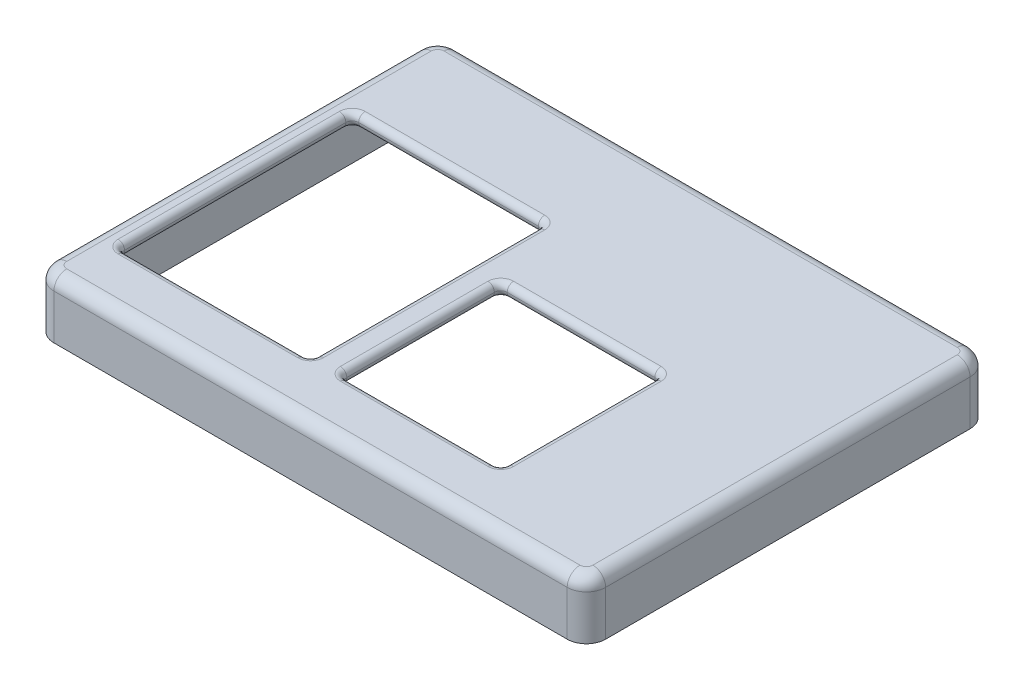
ISO-10303-21;
HEADER;
FILE_DESCRIPTION(('STEP AP214'),'2;1');
FILE_NAME('part.step','',(''),(''),'','','');
FILE_SCHEMA(('AUTOMOTIVE_DESIGN { 1 0 10303 214 1 1 1 1 }'));
ENDSEC;
DATA;
#1=APPLICATION_CONTEXT('core data for automotive mechanical design processes');
#2=APPLICATION_PROTOCOL_DEFINITION('international standard','automotive_design',2000,#1);
#3=PRODUCT_CONTEXT('',#1,'mechanical');
#4=PRODUCT('Part','Part','',(#3));
#5=PRODUCT_RELATED_PRODUCT_CATEGORY('part','',(#4));
#6=PRODUCT_DEFINITION_FORMATION('','',#4);
#7=PRODUCT_DEFINITION_CONTEXT('part definition',#1,'design');
#8=PRODUCT_DEFINITION('design','',#6,#7);
#9=PRODUCT_DEFINITION_SHAPE('','',#8);
#10=(LENGTH_UNIT() NAMED_UNIT(*) SI_UNIT(.MILLI.,.METRE.));
#11=(NAMED_UNIT(*) PLANE_ANGLE_UNIT() SI_UNIT($,.RADIAN.));
#12=(NAMED_UNIT(*) SI_UNIT($,.STERADIAN.) SOLID_ANGLE_UNIT());
#13=UNCERTAINTY_MEASURE_WITH_UNIT(LENGTH_MEASURE(1.E-05),#10,'distance_accuracy_value','');
#14=(GEOMETRIC_REPRESENTATION_CONTEXT(3) GLOBAL_UNCERTAINTY_ASSIGNED_CONTEXT((#13)) GLOBAL_UNIT_ASSIGNED_CONTEXT((#10,
#11,#12)) REPRESENTATION_CONTEXT('',''));
#15=CARTESIAN_POINT('',(0.,0.,0.));
#16=DIRECTION('',(0.,0.,1.));
#17=DIRECTION('',(1.,0.,0.));
#18=AXIS2_PLACEMENT_3D('',#15,#16,#17);
#19=CARTESIAN_POINT('',(0.,7.,0.));
#20=DIRECTION('',(0.,-1.,0.));
#21=DIRECTION('',(0.,0.,-1.));
#22=AXIS2_PLACEMENT_3D('',#19,#20,#21);
#23=PLANE('',#22);
#24=CARTESIAN_POINT('',(-38.,7.,-13.1));
#25=DIRECTION('',(0.,-1.,0.));
#26=DIRECTION('',(0.,0.,-1.));
#27=AXIS2_PLACEMENT_3D('',#24,#25,#26);
#28=CIRCLE('',#27,2.);
#29=CARTESIAN_POINT('',(-40.,7.,-13.1));
#30=VERTEX_POINT('',#29);
#31=CARTESIAN_POINT('',(-38.,7.,-15.1));
#32=VERTEX_POINT('',#31);
#33=EDGE_CURVE('E244',#30,#32,#28,.T.);
#34=ORIENTED_EDGE('',*,*,#33,.F.);
#35=DIRECTION('',(0.,0.,-1.));
#36=VECTOR('',#35,1.);
#37=CARTESIAN_POINT('',(-40.,7.,22.4));
#38=LINE('',#37,#36);
#39=CARTESIAN_POINT('',(-40.,7.,21.4));
#40=VERTEX_POINT('',#39);
#41=EDGE_CURVE('E1030',#30,#40,#38,.F.);
#42=ORIENTED_EDGE('',*,*,#41,.T.);
#43=CARTESIAN_POINT('',(-38.,7.,21.4));
#44=DIRECTION('',(0.,-1.,0.));
#45=DIRECTION('',(0.,0.,-1.));
#46=AXIS2_PLACEMENT_3D('',#43,#44,#45);
#47=CIRCLE('',#46,2.);
#48=CARTESIAN_POINT('',(-38.,7.,23.4));
#49=VERTEX_POINT('',#48);
#50=EDGE_CURVE('E1027',#49,#40,#47,.T.);
#51=ORIENTED_EDGE('',*,*,#50,.F.);
#52=DIRECTION('',(-1.,0.,0.));
#53=VECTOR('',#52,1.);
#54=CARTESIAN_POINT('',(-8.99999999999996,7.,23.4));
#55=LINE('',#54,#53);
#56=CARTESIAN_POINT('',(-9.99999999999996,7.,23.4));
#57=VERTEX_POINT('',#56);
#58=EDGE_CURVE('E1020',#49,#57,#55,.F.);
#59=ORIENTED_EDGE('',*,*,#58,.T.);
#60=CARTESIAN_POINT('',(-9.99999999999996,7.,21.4));
#61=DIRECTION('',(0.,-1.,0.));
#62=DIRECTION('',(0.,0.,-1.));
#63=AXIS2_PLACEMENT_3D('',#60,#61,#62);
#64=CIRCLE('',#63,2.);
#65=CARTESIAN_POINT('',(-7.99999999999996,7.,21.4));
#66=VERTEX_POINT('',#65);
#67=EDGE_CURVE('E1010',#66,#57,#64,.T.);
#68=ORIENTED_EDGE('',*,*,#67,.F.);
#69=DIRECTION('',(0.,0.,1.));
#70=VECTOR('',#69,1.);
#71=CARTESIAN_POINT('',(-7.99999999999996,7.,-14.1));
#72=LINE('',#71,#70);
#73=CARTESIAN_POINT('',(-7.99999999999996,7.,-13.1));
#74=VERTEX_POINT('',#73);
#75=EDGE_CURVE('E997',#66,#74,#72,.F.);
#76=ORIENTED_EDGE('',*,*,#75,.T.);
#77=CARTESIAN_POINT('',(-9.99999999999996,7.,-13.1));
#78=DIRECTION('',(0.,-1.,0.));
#79=DIRECTION('',(0.,0.,-1.));
#80=AXIS2_PLACEMENT_3D('',#77,#78,#79);
#81=CIRCLE('',#80,2.);
#82=CARTESIAN_POINT('',(-9.99999999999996,7.,-15.1));
#83=VERTEX_POINT('',#82);
#84=EDGE_CURVE('E1002',#83,#74,#81,.T.);
#85=ORIENTED_EDGE('',*,*,#84,.F.);
#86=DIRECTION('',(1.,0.,0.));
#87=VECTOR('',#86,1.);
#88=CARTESIAN_POINT('',(-39.,7.,-15.1));
#89=LINE('',#88,#87);
#90=EDGE_CURVE('E1024',#83,#32,#89,.F.);
#91=ORIENTED_EDGE('',*,*,#90,.T.);
#92=EDGE_LOOP('',(#34,#42,#51,#59,#68,#76,#85,#91));
#93=FACE_BOUND('',#92,.T.);
#94=DIRECTION('',(0.,0.,-1.));
#95=VECTOR('',#94,1.);
#96=CARTESIAN_POINT('',(41.,7.,-29.4));
#97=LINE('',#96,#95);
#98=CARTESIAN_POINT('',(41.,7.,29.4));
#99=VERTEX_POINT('',#98);
#100=CARTESIAN_POINT('',(41.,7.,-29.4));
#101=VERTEX_POINT('',#100);
#102=EDGE_CURVE('E1170',#99,#101,#97,.T.);
#103=ORIENTED_EDGE('',*,*,#102,.F.);
#104=DIRECTION('',(1.,0.,0.));
#105=VECTOR('',#104,1.);
#106=CARTESIAN_POINT('',(-41.,7.,29.4));
#107=LINE('',#106,#105);
#108=CARTESIAN_POINT('',(-41.,7.,29.4));
#109=VERTEX_POINT('',#108);
#110=EDGE_CURVE('E1424',#109,#99,#107,.T.);
#111=ORIENTED_EDGE('',*,*,#110,.F.);
#112=DIRECTION('',(0.,0.,1.));
#113=VECTOR('',#112,1.);
#114=CARTESIAN_POINT('',(-41.,7.,-29.4));
#115=LINE('',#114,#113);
#116=CARTESIAN_POINT('',(-41.,7.,-29.4));
#117=VERTEX_POINT('',#116);
#118=EDGE_CURVE('E1173',#117,#109,#115,.T.);
#119=ORIENTED_EDGE('',*,*,#118,.F.);
#120=DIRECTION('',(-1.,0.,0.));
#121=VECTOR('',#120,1.);
#122=CARTESIAN_POINT('',(-41.,7.,-29.4));
#123=LINE('',#122,#121);
#124=EDGE_CURVE('E1168',#101,#117,#123,.T.);
#125=ORIENTED_EDGE('',*,*,#124,.F.);
#126=EDGE_LOOP('',(#103,#111,#119,#125));
#127=FACE_BOUND('',#126,.T.);
#128=CARTESIAN_POINT('',(19.5,7.,-1.75));
#129=DIRECTION('',(0.,-1.,0.));
#130=DIRECTION('',(0.,0.,-1.));
#131=AXIS2_PLACEMENT_3D('',#128,#129,#130);
#132=CIRCLE('',#131,2.);
#133=CARTESIAN_POINT('',(19.5,7.,-3.75));
#134=VERTEX_POINT('',#133);
#135=CARTESIAN_POINT('',(21.5,7.,-1.75));
#136=VERTEX_POINT('',#135);
#137=EDGE_CURVE('E11',#134,#136,#132,.T.);
#138=ORIENTED_EDGE('',*,*,#137,.F.);
#139=DIRECTION('',(1.,0.,0.));
#140=VECTOR('',#139,1.);
#141=CARTESIAN_POINT('',(-4.49999999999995,7.,-3.75));
#142=LINE('',#141,#140);
#143=CARTESIAN_POINT('',(-3.49999999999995,7.,-3.75));
#144=VERTEX_POINT('',#143);
#145=EDGE_CURVE('E52',#134,#144,#142,.F.);
#146=ORIENTED_EDGE('',*,*,#145,.T.);
#147=CARTESIAN_POINT('',(-3.49999999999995,7.,-1.75));
#148=DIRECTION('',(0.,-1.,0.));
#149=DIRECTION('',(0.,0.,-1.));
#150=AXIS2_PLACEMENT_3D('',#147,#148,#149);
#151=CIRCLE('',#150,2.);
#152=CARTESIAN_POINT('',(-5.49999999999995,7.,-1.75));
#153=VERTEX_POINT('',#152);
#154=EDGE_CURVE('E166',#153,#144,#151,.T.);
#155=ORIENTED_EDGE('',*,*,#154,.F.);
#156=DIRECTION('',(0.,0.,-1.));
#157=VECTOR('',#156,1.);
#158=CARTESIAN_POINT('',(-5.49999999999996,7.,22.25));
#159=LINE('',#158,#157);
#160=CARTESIAN_POINT('',(-5.49999999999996,7.,21.25));
#161=VERTEX_POINT('',#160);
#162=EDGE_CURVE('E168',#153,#161,#159,.F.);
#163=ORIENTED_EDGE('',*,*,#162,.T.);
#164=CARTESIAN_POINT('',(-3.49999999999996,7.,21.25));
#165=DIRECTION('',(0.,-1.,0.));
#166=DIRECTION('',(0.,0.,-1.));
#167=AXIS2_PLACEMENT_3D('',#164,#165,#166);
#168=CIRCLE('',#167,2.);
#169=CARTESIAN_POINT('',(-3.49999999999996,7.,23.25));
#170=VERTEX_POINT('',#169);
#171=EDGE_CURVE('E183',#170,#161,#168,.T.);
#172=ORIENTED_EDGE('',*,*,#171,.F.);
#173=DIRECTION('',(-1.,0.,0.));
#174=VECTOR('',#173,1.);
#175=CARTESIAN_POINT('',(20.5,7.,23.25));
#176=LINE('',#175,#174);
#177=CARTESIAN_POINT('',(19.5,7.,23.25));
#178=VERTEX_POINT('',#177);
#179=EDGE_CURVE('E363',#170,#178,#176,.F.);
#180=ORIENTED_EDGE('',*,*,#179,.T.);
#181=CARTESIAN_POINT('',(19.5,7.,21.25));
#182=DIRECTION('',(0.,-1.,0.));
#183=DIRECTION('',(0.,0.,-1.));
#184=AXIS2_PLACEMENT_3D('',#181,#182,#183);
#185=CIRCLE('',#184,2.);
#186=CARTESIAN_POINT('',(21.5,7.,21.25));
#187=VERTEX_POINT('',#186);
#188=EDGE_CURVE('E359',#187,#178,#185,.T.);
#189=ORIENTED_EDGE('',*,*,#188,.F.);
#190=DIRECTION('',(0.,0.,1.));
#191=VECTOR('',#190,1.);
#192=CARTESIAN_POINT('',(21.5,7.,-2.75));
#193=LINE('',#192,#191);
#194=EDGE_CURVE('E366',#187,#136,#193,.F.);
#195=ORIENTED_EDGE('',*,*,#194,.T.);
#196=EDGE_LOOP('',(#138,#146,#155,#163,#172,#180,#189,#195));
#197=FACE_BOUND('',#196,.T.);
#198=ADVANCED_FACE('F41',(#93,#127,#197),#23,.T.);
#199=CARTESIAN_POINT('',(0.,9.,0.));
#200=DIRECTION('',(0.,-1.,0.));
#201=DIRECTION('',(0.,0.,-1.));
#202=AXIS2_PLACEMENT_3D('',#199,#200,#201);
#203=PLANE('',#202);
#204=CARTESIAN_POINT('',(-38.,9.,21.4));
#205=DIRECTION('',(0.,-1.,0.));
#206=DIRECTION('',(0.,0.,-1.));
#207=AXIS2_PLACEMENT_3D('',#204,#205,#206);
#208=CIRCLE('',#207,2.);
#209=CARTESIAN_POINT('',(-40.,9.,21.4));
#210=VERTEX_POINT('',#209);
#211=CARTESIAN_POINT('',(-38.,9.,23.4));
#212=VERTEX_POINT('',#211);
#213=EDGE_CURVE('E1006',#210,#212,#208,.F.);
#214=ORIENTED_EDGE('',*,*,#213,.F.);
#215=DIRECTION('',(0.,0.,-1.));
#216=VECTOR('',#215,1.);
#217=CARTESIAN_POINT('',(-40.,9.,0.));
#218=LINE('',#217,#216);
#219=CARTESIAN_POINT('',(-40.,9.,-13.1));
#220=VERTEX_POINT('',#219);
#221=EDGE_CURVE('E1013',#210,#220,#218,.T.);
#222=ORIENTED_EDGE('',*,*,#221,.T.);
#223=CARTESIAN_POINT('',(-38.,9.,-13.1));
#224=DIRECTION('',(0.,-1.,0.));
#225=DIRECTION('',(0.,0.,-1.));
#226=AXIS2_PLACEMENT_3D('',#223,#224,#225);
#227=CIRCLE('',#226,2.);
#228=CARTESIAN_POINT('',(-38.,9.,-15.1));
#229=VERTEX_POINT('',#228);
#230=EDGE_CURVE('E1350',#229,#220,#227,.F.);
#231=ORIENTED_EDGE('',*,*,#230,.F.);
#232=DIRECTION('',(1.,0.,0.));
#233=VECTOR('',#232,1.);
#234=CARTESIAN_POINT('',(0.,9.,-15.1));
#235=LINE('',#234,#233);
#236=CARTESIAN_POINT('',(-9.99999999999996,9.,-15.1));
#237=VERTEX_POINT('',#236);
#238=EDGE_CURVE('E1347',#229,#237,#235,.T.);
#239=ORIENTED_EDGE('',*,*,#238,.T.);
#240=CARTESIAN_POINT('',(-9.99999999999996,9.,-13.1));
#241=DIRECTION('',(0.,-1.,0.));
#242=DIRECTION('',(0.,0.,-1.));
#243=AXIS2_PLACEMENT_3D('',#240,#241,#242);
#244=CIRCLE('',#243,2.);
#245=CARTESIAN_POINT('',(-7.99999999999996,9.,-13.1));
#246=VERTEX_POINT('',#245);
#247=EDGE_CURVE('E1343',#246,#237,#244,.F.);
#248=ORIENTED_EDGE('',*,*,#247,.F.);
#249=DIRECTION('',(0.,0.,1.));
#250=VECTOR('',#249,1.);
#251=CARTESIAN_POINT('',(-7.99999999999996,9.,0.));
#252=LINE('',#251,#250);
#253=CARTESIAN_POINT('',(-7.99999999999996,9.,21.4));
#254=VERTEX_POINT('',#253);
#255=EDGE_CURVE('E1337',#246,#254,#252,.T.);
#256=ORIENTED_EDGE('',*,*,#255,.T.);
#257=CARTESIAN_POINT('',(-9.99999999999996,9.,21.4));
#258=DIRECTION('',(0.,-1.,0.));
#259=DIRECTION('',(0.,0.,-1.));
#260=AXIS2_PLACEMENT_3D('',#257,#258,#259);
#261=CIRCLE('',#260,2.);
#262=CARTESIAN_POINT('',(-9.99999999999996,9.,23.4));
#263=VERTEX_POINT('',#262);
#264=EDGE_CURVE('E1303',#263,#254,#261,.F.);
#265=ORIENTED_EDGE('',*,*,#264,.F.);
#266=DIRECTION('',(-1.,0.,0.));
#267=VECTOR('',#266,1.);
#268=CARTESIAN_POINT('',(0.,9.,23.4));
#269=LINE('',#268,#267);
#270=EDGE_CURVE('E1340',#263,#212,#269,.T.);
#271=ORIENTED_EDGE('',*,*,#270,.T.);
#272=EDGE_LOOP('',(#214,#222,#231,#239,#248,#256,#265,#271));
#273=FACE_BOUND('',#272,.T.);
#274=CARTESIAN_POINT('',(-40.,9.,-28.4));
#275=DIRECTION('',(0.,-1.,0.));
#276=DIRECTION('',(0.,0.,-1.));
#277=AXIS2_PLACEMENT_3D('',#274,#275,#276);
#278=CIRCLE('',#277,1.);
#279=CARTESIAN_POINT('',(-40.,9.,-29.4));
#280=VERTEX_POINT('',#279);
#281=CARTESIAN_POINT('',(-41.,9.,-28.4));
#282=VERTEX_POINT('',#281);
#283=EDGE_CURVE('E1269',#280,#282,#278,.F.);
#284=ORIENTED_EDGE('',*,*,#283,.T.);
#285=DIRECTION('',(0.,0.,1.));
#286=VECTOR('',#285,1.);
#287=CARTESIAN_POINT('',(-41.,9.,0.));
#288=LINE('',#287,#286);
#289=CARTESIAN_POINT('',(-41.,9.,28.4));
#290=VERTEX_POINT('',#289);
#291=EDGE_CURVE('E1275',#282,#290,#288,.T.);
#292=ORIENTED_EDGE('',*,*,#291,.T.);
#293=CARTESIAN_POINT('',(-40.,9.,28.4));
#294=DIRECTION('',(0.,-1.,0.));
#295=DIRECTION('',(0.,0.,-1.));
#296=AXIS2_PLACEMENT_3D('',#293,#294,#295);
#297=CIRCLE('',#296,1.);
#298=CARTESIAN_POINT('',(-40.,9.,29.4));
#299=VERTEX_POINT('',#298);
#300=EDGE_CURVE('E1272',#290,#299,#297,.F.);
#301=ORIENTED_EDGE('',*,*,#300,.T.);
#302=DIRECTION('',(1.,0.,0.));
#303=VECTOR('',#302,1.);
#304=CARTESIAN_POINT('',(0.,9.,29.4));
#305=LINE('',#304,#303);
#306=CARTESIAN_POINT('',(40.,9.,29.4));
#307=VERTEX_POINT('',#306);
#308=EDGE_CURVE('E1266',#299,#307,#305,.T.);
#309=ORIENTED_EDGE('',*,*,#308,.T.);
#310=CARTESIAN_POINT('',(40.,9.,28.4));
#311=DIRECTION('',(0.,-1.,0.));
#312=DIRECTION('',(0.,0.,-1.));
#313=AXIS2_PLACEMENT_3D('',#310,#311,#312);
#314=CIRCLE('',#313,1.);
#315=CARTESIAN_POINT('',(41.,9.,28.4));
#316=VERTEX_POINT('',#315);
#317=EDGE_CURVE('E1259',#307,#316,#314,.F.);
#318=ORIENTED_EDGE('',*,*,#317,.T.);
#319=DIRECTION('',(0.,0.,-1.));
#320=VECTOR('',#319,1.);
#321=CARTESIAN_POINT('',(41.,9.,0.));
#322=LINE('',#321,#320);
#323=CARTESIAN_POINT('',(41.,9.,-28.4));
#324=VERTEX_POINT('',#323);
#325=EDGE_CURVE('E1253',#316,#324,#322,.T.);
#326=ORIENTED_EDGE('',*,*,#325,.T.);
#327=CARTESIAN_POINT('',(40.,9.,-28.4));
#328=DIRECTION('',(0.,-1.,0.));
#329=DIRECTION('',(0.,0.,-1.));
#330=AXIS2_PLACEMENT_3D('',#327,#328,#329);
#331=CIRCLE('',#330,1.);
#332=CARTESIAN_POINT('',(40.,9.,-29.4));
#333=VERTEX_POINT('',#332);
#334=EDGE_CURVE('E1256',#324,#333,#331,.F.);
#335=ORIENTED_EDGE('',*,*,#334,.T.);
#336=DIRECTION('',(-1.,0.,0.));
#337=VECTOR('',#336,1.);
#338=CARTESIAN_POINT('',(0.,9.,-29.4));
#339=LINE('',#338,#337);
#340=EDGE_CURVE('E1263',#333,#280,#339,.T.);
#341=ORIENTED_EDGE('',*,*,#340,.T.);
#342=EDGE_LOOP('',(#284,#292,#301,#309,#318,#326,#335,#341));
#343=FACE_BOUND('',#342,.T.);
#344=CARTESIAN_POINT('',(-3.49999999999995,9.,-1.75));
#345=DIRECTION('',(0.,-1.,0.));
#346=DIRECTION('',(0.,0.,-1.));
#347=AXIS2_PLACEMENT_3D('',#344,#345,#346);
#348=CIRCLE('',#347,2.);
#349=CARTESIAN_POINT('',(-3.49999999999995,9.,-3.75));
#350=VERTEX_POINT('',#349);
#351=CARTESIAN_POINT('',(-5.49999999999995,9.,-1.75));
#352=VERTEX_POINT('',#351);
#353=EDGE_CURVE('E355',#350,#352,#348,.F.);
#354=ORIENTED_EDGE('',*,*,#353,.F.);
#355=DIRECTION('',(1.,0.,0.));
#356=VECTOR('',#355,1.);
#357=CARTESIAN_POINT('',(0.,9.,-3.75));
#358=LINE('',#357,#356);
#359=CARTESIAN_POINT('',(19.5,9.,-3.75));
#360=VERTEX_POINT('',#359);
#361=EDGE_CURVE('E351',#350,#360,#358,.T.);
#362=ORIENTED_EDGE('',*,*,#361,.T.);
#363=CARTESIAN_POINT('',(19.5,9.,-1.75));
#364=DIRECTION('',(0.,-1.,0.));
#365=DIRECTION('',(0.,0.,-1.));
#366=AXIS2_PLACEMENT_3D('',#363,#364,#365);
#367=CIRCLE('',#366,2.);
#368=CARTESIAN_POINT('',(21.5,9.,-1.75));
#369=VERTEX_POINT('',#368);
#370=EDGE_CURVE('E347',#369,#360,#367,.F.);
#371=ORIENTED_EDGE('',*,*,#370,.F.);
#372=DIRECTION('',(0.,0.,1.));
#373=VECTOR('',#372,1.);
#374=CARTESIAN_POINT('',(21.5,9.,0.));
#375=LINE('',#374,#373);
#376=CARTESIAN_POINT('',(21.5,9.,21.25));
#377=VERTEX_POINT('',#376);
#378=EDGE_CURVE('E341',#369,#377,#375,.T.);
#379=ORIENTED_EDGE('',*,*,#378,.T.);
#380=CARTESIAN_POINT('',(19.5,9.,21.25));
#381=DIRECTION('',(0.,-1.,0.));
#382=DIRECTION('',(0.,0.,-1.));
#383=AXIS2_PLACEMENT_3D('',#380,#381,#382);
#384=CIRCLE('',#383,2.);
#385=CARTESIAN_POINT('',(19.5,9.,23.25));
#386=VERTEX_POINT('',#385);
#387=EDGE_CURVE('E337',#386,#377,#384,.F.);
#388=ORIENTED_EDGE('',*,*,#387,.F.);
#389=DIRECTION('',(-1.,0.,0.));
#390=VECTOR('',#389,1.);
#391=CARTESIAN_POINT('',(0.,9.,23.25));
#392=LINE('',#391,#390);
#393=CARTESIAN_POINT('',(-3.49999999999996,9.,23.25));
#394=VERTEX_POINT('',#393);
#395=EDGE_CURVE('E334',#386,#394,#392,.T.);
#396=ORIENTED_EDGE('',*,*,#395,.T.);
#397=CARTESIAN_POINT('',(-3.49999999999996,9.,21.25));
#398=DIRECTION('',(0.,-1.,0.));
#399=DIRECTION('',(0.,0.,-1.));
#400=AXIS2_PLACEMENT_3D('',#397,#398,#399);
#401=CIRCLE('',#400,2.);
#402=CARTESIAN_POINT('',(-5.49999999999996,9.,21.25));
#403=VERTEX_POINT('',#402);
#404=EDGE_CURVE('E330',#403,#394,#401,.F.);
#405=ORIENTED_EDGE('',*,*,#404,.F.);
#406=DIRECTION('',(0.,0.,-1.));
#407=VECTOR('',#406,1.);
#408=CARTESIAN_POINT('',(-5.49999999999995,9.,0.));
#409=LINE('',#408,#407);
#410=EDGE_CURVE('E344',#403,#352,#409,.T.);
#411=ORIENTED_EDGE('',*,*,#410,.T.);
#412=EDGE_LOOP('',(#354,#362,#371,#379,#388,#396,#405,#411));
#413=FACE_BOUND('',#412,.T.);
#414=ADVANCED_FACE('F425',(#273,#343,#413),#203,.F.);
#415=CARTESIAN_POINT('',(0.,0.,0.));
#416=DIRECTION('',(0.,-1.,0.));
#417=DIRECTION('',(0.,0.,-1.));
#418=AXIS2_PLACEMENT_3D('',#415,#416,#417);
#419=PLANE('',#418);
#420=DIRECTION('',(0.,0.,-1.));
#421=VECTOR('',#420,1.);
#422=CARTESIAN_POINT('',(43.,0.,31.4));
#423=LINE('',#422,#421);
#424=CARTESIAN_POINT('',(43.,0.,28.4));
#425=VERTEX_POINT('',#424);
#426=CARTESIAN_POINT('',(43.,0.,-28.4));
#427=VERTEX_POINT('',#426);
#428=EDGE_CURVE('E1190',#425,#427,#423,.T.);
#429=ORIENTED_EDGE('',*,*,#428,.F.);
#430=CARTESIAN_POINT('',(40.,0.,28.4));
#431=DIRECTION('',(0.,-1.,0.));
#432=DIRECTION('',(0.,0.,-1.));
#433=AXIS2_PLACEMENT_3D('',#430,#431,#432);
#434=CIRCLE('',#433,3.);
#435=CARTESIAN_POINT('',(40.,0.,31.4));
#436=VERTEX_POINT('',#435);
#437=EDGE_CURVE('E1229',#425,#436,#434,.T.);
#438=ORIENTED_EDGE('',*,*,#437,.T.);
#439=DIRECTION('',(1.,0.,0.));
#440=VECTOR('',#439,1.);
#441=CARTESIAN_POINT('',(-43.,0.,31.4));
#442=LINE('',#441,#440);
#443=CARTESIAN_POINT('',(-40.,0.,31.4));
#444=VERTEX_POINT('',#443);
#445=EDGE_CURVE('E1209',#444,#436,#442,.T.);
#446=ORIENTED_EDGE('',*,*,#445,.F.);
#447=CARTESIAN_POINT('',(-40.,0.,28.4));
#448=DIRECTION('',(0.,-1.,0.));
#449=DIRECTION('',(0.,0.,-1.));
#450=AXIS2_PLACEMENT_3D('',#447,#448,#449);
#451=CIRCLE('',#450,3.);
#452=CARTESIAN_POINT('',(-43.,0.,28.4));
#453=VERTEX_POINT('',#452);
#454=EDGE_CURVE('E1220',#444,#453,#451,.T.);
#455=ORIENTED_EDGE('',*,*,#454,.T.);
#456=DIRECTION('',(0.,0.,1.));
#457=VECTOR('',#456,1.);
#458=CARTESIAN_POINT('',(-43.,0.,31.4));
#459=LINE('',#458,#457);
#460=CARTESIAN_POINT('',(-43.,0.,-28.4));
#461=VERTEX_POINT('',#460);
#462=EDGE_CURVE('E1205',#461,#453,#459,.T.);
#463=ORIENTED_EDGE('',*,*,#462,.F.);
#464=CARTESIAN_POINT('',(-40.,0.,-28.4));
#465=DIRECTION('',(0.,-1.,0.));
#466=DIRECTION('',(0.,0.,-1.));
#467=AXIS2_PLACEMENT_3D('',#464,#465,#466);
#468=CIRCLE('',#467,3.);
#469=CARTESIAN_POINT('',(-40.,0.,-31.4));
#470=VERTEX_POINT('',#469);
#471=EDGE_CURVE('E1223',#461,#470,#468,.T.);
#472=ORIENTED_EDGE('',*,*,#471,.T.);
#473=DIRECTION('',(-1.,0.,0.));
#474=VECTOR('',#473,1.);
#475=CARTESIAN_POINT('',(-43.,0.,-31.4));
#476=LINE('',#475,#474);
#477=CARTESIAN_POINT('',(40.,0.,-31.4));
#478=VERTEX_POINT('',#477);
#479=EDGE_CURVE('E1196',#478,#470,#476,.T.);
#480=ORIENTED_EDGE('',*,*,#479,.F.);
#481=CARTESIAN_POINT('',(40.,0.,-28.4));
#482=DIRECTION('',(0.,-1.,0.));
#483=DIRECTION('',(0.,0.,-1.));
#484=AXIS2_PLACEMENT_3D('',#481,#482,#483);
#485=CIRCLE('',#484,3.);
#486=EDGE_CURVE('E1226',#478,#427,#485,.T.);
#487=ORIENTED_EDGE('',*,*,#486,.T.);
#488=EDGE_LOOP('',(#429,#438,#446,#455,#463,#472,#480,#487));
#489=FACE_BOUND('',#488,.T.);
#490=DIRECTION('',(1.,0.,0.));
#491=VECTOR('',#490,1.);
#492=CARTESIAN_POINT('',(-41.,0.,29.4));
#493=LINE('',#492,#491);
#494=CARTESIAN_POINT('',(-41.,0.,29.4));
#495=VERTEX_POINT('',#494);
#496=CARTESIAN_POINT('',(41.,0.,29.4));
#497=VERTEX_POINT('',#496);
#498=EDGE_CURVE('E1185',#495,#497,#493,.T.);
#499=ORIENTED_EDGE('',*,*,#498,.T.);
#500=DIRECTION('',(0.,0.,-1.));
#501=VECTOR('',#500,1.);
#502=CARTESIAN_POINT('',(41.,0.,-29.4));
#503=LINE('',#502,#501);
#504=CARTESIAN_POINT('',(41.,0.,-29.4));
#505=VERTEX_POINT('',#504);
#506=EDGE_CURVE('E1333',#497,#505,#503,.T.);
#507=ORIENTED_EDGE('',*,*,#506,.T.);
#508=DIRECTION('',(-1.,0.,0.));
#509=VECTOR('',#508,1.);
#510=CARTESIAN_POINT('',(-41.,0.,-29.4));
#511=LINE('',#510,#509);
#512=CARTESIAN_POINT('',(-41.,0.,-29.4));
#513=VERTEX_POINT('',#512);
#514=EDGE_CURVE('E1188',#505,#513,#511,.T.);
#515=ORIENTED_EDGE('',*,*,#514,.T.);
#516=DIRECTION('',(0.,0.,1.));
#517=VECTOR('',#516,1.);
#518=CARTESIAN_POINT('',(-41.,0.,-29.4));
#519=LINE('',#518,#517);
#520=EDGE_CURVE('E1415',#513,#495,#519,.T.);
#521=ORIENTED_EDGE('',*,*,#520,.T.);
#522=EDGE_LOOP('',(#499,#507,#515,#521));
#523=FACE_BOUND('',#522,.T.);
#524=ADVANCED_FACE('F447',(#489,#523),#419,.T.);
#525=CARTESIAN_POINT('',(43.,7.,31.4));
#526=DIRECTION('',(-1.,0.,0.));
#527=DIRECTION('',(0.,0.,1.));
#528=AXIS2_PLACEMENT_3D('',#525,#526,#527);
#529=PLANE('',#528);
#530=DIRECTION('',(0.,-1.,0.));
#531=VECTOR('',#530,1.);
#532=CARTESIAN_POINT('',(43.,7.,-28.4));
#533=LINE('',#532,#531);
#534=CARTESIAN_POINT('',(43.,7.,-28.4));
#535=VERTEX_POINT('',#534);
#536=EDGE_CURVE('E1213',#427,#535,#533,.F.);
#537=ORIENTED_EDGE('',*,*,#536,.T.);
#538=DIRECTION('',(0.,0.,-1.));
#539=VECTOR('',#538,1.);
#540=CARTESIAN_POINT('',(43.,7.,31.4));
#541=LINE('',#540,#539);
#542=CARTESIAN_POINT('',(43.,7.,28.4));
#543=VERTEX_POINT('',#542);
#544=EDGE_CURVE('E1300',#535,#543,#541,.F.);
#545=ORIENTED_EDGE('',*,*,#544,.T.);
#546=DIRECTION('',(0.,-1.,0.));
#547=VECTOR('',#546,1.);
#548=CARTESIAN_POINT('',(43.,7.,28.4));
#549=LINE('',#548,#547);
#550=EDGE_CURVE('E1217',#543,#425,#549,.T.);
#551=ORIENTED_EDGE('',*,*,#550,.T.);
#552=ORIENTED_EDGE('',*,*,#428,.T.);
#553=EDGE_LOOP('',(#537,#545,#551,#552));
#554=FACE_BOUND('',#553,.T.);
#555=ADVANCED_FACE('F473',(#554),#529,.F.);
#556=CARTESIAN_POINT('',(-43.,7.,-31.4));
#557=DIRECTION('',(0.,0.,1.));
#558=DIRECTION('',(1.,0.,0.));
#559=AXIS2_PLACEMENT_3D('',#556,#557,#558);
#560=PLANE('',#559);
#561=DIRECTION('',(0.,-1.,0.));
#562=VECTOR('',#561,1.);
#563=CARTESIAN_POINT('',(-40.,7.,-31.4));
#564=LINE('',#563,#562);
#565=CARTESIAN_POINT('',(-40.,7.,-31.4));
#566=VERTEX_POINT('',#565);
#567=EDGE_CURVE('E1239',#470,#566,#564,.F.);
#568=ORIENTED_EDGE('',*,*,#567,.T.);
#569=DIRECTION('',(-1.,0.,0.));
#570=VECTOR('',#569,1.);
#571=CARTESIAN_POINT('',(-43.,7.,-31.4));
#572=LINE('',#571,#570);
#573=CARTESIAN_POINT('',(40.,7.,-31.4));
#574=VERTEX_POINT('',#573);
#575=EDGE_CURVE('E1297',#566,#574,#572,.F.);
#576=ORIENTED_EDGE('',*,*,#575,.T.);
#577=DIRECTION('',(0.,-1.,0.));
#578=VECTOR('',#577,1.);
#579=CARTESIAN_POINT('',(40.,7.,-31.4));
#580=LINE('',#579,#578);
#581=EDGE_CURVE('E1243',#574,#478,#580,.T.);
#582=ORIENTED_EDGE('',*,*,#581,.T.);
#583=ORIENTED_EDGE('',*,*,#479,.T.);
#584=EDGE_LOOP('',(#568,#576,#582,#583));
#585=FACE_BOUND('',#584,.T.);
#586=ADVANCED_FACE('F481',(#585),#560,.F.);
#587=CARTESIAN_POINT('',(-43.,7.,31.4));
#588=DIRECTION('',(1.,0.,0.));
#589=DIRECTION('',(0.,0.,-1.));
#590=AXIS2_PLACEMENT_3D('',#587,#588,#589);
#591=PLANE('',#590);
#592=DIRECTION('',(0.,-1.,0.));
#593=VECTOR('',#592,1.);
#594=CARTESIAN_POINT('',(-43.,7.,28.4));
#595=LINE('',#594,#593);
#596=CARTESIAN_POINT('',(-43.,7.,28.4));
#597=VERTEX_POINT('',#596);
#598=EDGE_CURVE('E1246',#453,#597,#595,.F.);
#599=ORIENTED_EDGE('',*,*,#598,.T.);
#600=DIRECTION('',(0.,0.,1.));
#601=VECTOR('',#600,1.);
#602=CARTESIAN_POINT('',(-43.,7.,31.4));
#603=LINE('',#602,#601);
#604=CARTESIAN_POINT('',(-43.,7.,-28.4));
#605=VERTEX_POINT('',#604);
#606=EDGE_CURVE('E1294',#597,#605,#603,.F.);
#607=ORIENTED_EDGE('',*,*,#606,.T.);
#608=DIRECTION('',(0.,-1.,0.));
#609=VECTOR('',#608,1.);
#610=CARTESIAN_POINT('',(-43.,7.,-28.4));
#611=LINE('',#610,#609);
#612=EDGE_CURVE('E1250',#605,#461,#611,.T.);
#613=ORIENTED_EDGE('',*,*,#612,.T.);
#614=ORIENTED_EDGE('',*,*,#462,.T.);
#615=EDGE_LOOP('',(#599,#607,#613,#614));
#616=FACE_BOUND('',#615,.T.);
#617=ADVANCED_FACE('F477',(#616),#591,.F.);
#618=CARTESIAN_POINT('',(-43.,7.,31.4));
#619=DIRECTION('',(0.,0.,-1.));
#620=DIRECTION('',(-1.,0.,0.));
#621=AXIS2_PLACEMENT_3D('',#618,#619,#620);
#622=PLANE('',#621);
#623=DIRECTION('',(0.,-1.,0.));
#624=VECTOR('',#623,1.);
#625=CARTESIAN_POINT('',(40.,7.,31.4));
#626=LINE('',#625,#624);
#627=CARTESIAN_POINT('',(40.,7.,31.4));
#628=VERTEX_POINT('',#627);
#629=EDGE_CURVE('E1235',#436,#628,#626,.F.);
#630=ORIENTED_EDGE('',*,*,#629,.T.);
#631=DIRECTION('',(1.,0.,0.));
#632=VECTOR('',#631,1.);
#633=CARTESIAN_POINT('',(-43.,7.,31.4));
#634=LINE('',#633,#632);
#635=CARTESIAN_POINT('',(-40.,7.,31.4));
#636=VERTEX_POINT('',#635);
#637=EDGE_CURVE('E1291',#628,#636,#634,.F.);
#638=ORIENTED_EDGE('',*,*,#637,.T.);
#639=DIRECTION('',(0.,-1.,0.));
#640=VECTOR('',#639,1.);
#641=CARTESIAN_POINT('',(-40.,7.,31.4));
#642=LINE('',#641,#640);
#643=EDGE_CURVE('E1232',#636,#444,#642,.T.);
#644=ORIENTED_EDGE('',*,*,#643,.T.);
#645=ORIENTED_EDGE('',*,*,#445,.T.);
#646=EDGE_LOOP('',(#630,#638,#644,#645));
#647=FACE_BOUND('',#646,.T.);
#648=ADVANCED_FACE('F469',(#647),#622,.F.);
#649=CARTESIAN_POINT('',(41.,7.,-29.4));
#650=DIRECTION('',(-1.,0.,0.));
#651=DIRECTION('',(0.,0.,1.));
#652=AXIS2_PLACEMENT_3D('',#649,#650,#651);
#653=PLANE('',#652);
#654=ORIENTED_EDGE('',*,*,#506,.F.);
#655=DIRECTION('',(0.,-1.,0.));
#656=VECTOR('',#655,1.);
#657=CARTESIAN_POINT('',(41.,7.,29.4));
#658=LINE('',#657,#656);
#659=EDGE_CURVE('E1183',#99,#497,#658,.T.);
#660=ORIENTED_EDGE('',*,*,#659,.F.);
#661=ORIENTED_EDGE('',*,*,#102,.T.);
#662=DIRECTION('',(0.,-1.,0.));
#663=VECTOR('',#662,1.);
#664=CARTESIAN_POINT('',(41.,7.,-29.4));
#665=LINE('',#664,#663);
#666=EDGE_CURVE('E1180',#101,#505,#665,.T.);
#667=ORIENTED_EDGE('',*,*,#666,.T.);
#668=EDGE_LOOP('',(#654,#660,#661,#667));
#669=FACE_BOUND('',#668,.T.);
#670=ADVANCED_FACE('F465',(#669),#653,.T.);
#671=CARTESIAN_POINT('',(-41.,7.,-29.4));
#672=DIRECTION('',(0.,0.,1.));
#673=DIRECTION('',(1.,0.,0.));
#674=AXIS2_PLACEMENT_3D('',#671,#672,#673);
#675=PLANE('',#674);
#676=ORIENTED_EDGE('',*,*,#514,.F.);
#677=ORIENTED_EDGE('',*,*,#666,.F.);
#678=ORIENTED_EDGE('',*,*,#124,.T.);
#679=DIRECTION('',(0.,-1.,0.));
#680=VECTOR('',#679,1.);
#681=CARTESIAN_POINT('',(-41.,7.,-29.4));
#682=LINE('',#681,#680);
#683=EDGE_CURVE('E1191',#117,#513,#682,.T.);
#684=ORIENTED_EDGE('',*,*,#683,.T.);
#685=EDGE_LOOP('',(#676,#677,#678,#684));
#686=FACE_BOUND('',#685,.T.);
#687=ADVANCED_FACE('F461',(#686),#675,.T.);
#688=CARTESIAN_POINT('',(-41.,7.,-29.4));
#689=DIRECTION('',(1.,0.,0.));
#690=DIRECTION('',(0.,0.,-1.));
#691=AXIS2_PLACEMENT_3D('',#688,#689,#690);
#692=PLANE('',#691);
#693=ORIENTED_EDGE('',*,*,#520,.F.);
#694=ORIENTED_EDGE('',*,*,#683,.F.);
#695=ORIENTED_EDGE('',*,*,#118,.T.);
#696=DIRECTION('',(0.,-1.,0.));
#697=VECTOR('',#696,1.);
#698=CARTESIAN_POINT('',(-41.,7.,29.4));
#699=LINE('',#698,#697);
#700=EDGE_CURVE('E1198',#109,#495,#699,.T.);
#701=ORIENTED_EDGE('',*,*,#700,.T.);
#702=EDGE_LOOP('',(#693,#694,#695,#701));
#703=FACE_BOUND('',#702,.T.);
#704=ADVANCED_FACE('F457',(#703),#692,.T.);
#705=CARTESIAN_POINT('',(-41.,7.,29.4));
#706=DIRECTION('',(0.,0.,-1.));
#707=DIRECTION('',(-1.,0.,0.));
#708=AXIS2_PLACEMENT_3D('',#705,#706,#707);
#709=PLANE('',#708);
#710=ORIENTED_EDGE('',*,*,#498,.F.);
#711=ORIENTED_EDGE('',*,*,#700,.F.);
#712=ORIENTED_EDGE('',*,*,#110,.T.);
#713=ORIENTED_EDGE('',*,*,#659,.T.);
#714=EDGE_LOOP('',(#710,#711,#712,#713));
#715=FACE_BOUND('',#714,.T.);
#716=ADVANCED_FACE('F453',(#715),#709,.T.);
#717=CARTESIAN_POINT('',(40.,7.,28.4));
#718=DIRECTION('',(0.,-1.,0.));
#719=DIRECTION('',(0.,0.,-1.));
#720=AXIS2_PLACEMENT_3D('',#717,#718,#719);
#721=CYLINDRICAL_SURFACE('',#720,3.);
#722=ORIENTED_EDGE('',*,*,#550,.F.);
#723=CARTESIAN_POINT('',(40.,7.,28.4));
#724=DIRECTION('',(0.,-1.,0.));
#725=DIRECTION('',(0.,0.,-1.));
#726=AXIS2_PLACEMENT_3D('',#723,#724,#725);
#727=CIRCLE('',#726,3.);
#728=EDGE_CURVE('E1278',#543,#628,#727,.T.);
#729=ORIENTED_EDGE('',*,*,#728,.T.);
#730=ORIENTED_EDGE('',*,*,#629,.F.);
#731=ORIENTED_EDGE('',*,*,#437,.F.);
#732=EDGE_LOOP('',(#722,#729,#730,#731));
#733=FACE_BOUND('',#732,.T.);
#734=ADVANCED_FACE('F456',(#733),#721,.T.);
#735=CARTESIAN_POINT('',(40.,7.,-28.4));
#736=DIRECTION('',(0.,-1.,0.));
#737=DIRECTION('',(0.,0.,-1.));
#738=AXIS2_PLACEMENT_3D('',#735,#736,#737);
#739=CYLINDRICAL_SURFACE('',#738,3.);
#740=ORIENTED_EDGE('',*,*,#581,.F.);
#741=CARTESIAN_POINT('',(40.,7.,-28.4));
#742=DIRECTION('',(0.,-1.,0.));
#743=DIRECTION('',(0.,0.,-1.));
#744=AXIS2_PLACEMENT_3D('',#741,#742,#743);
#745=CIRCLE('',#744,3.);
#746=EDGE_CURVE('E1288',#574,#535,#745,.T.);
#747=ORIENTED_EDGE('',*,*,#746,.T.);
#748=ORIENTED_EDGE('',*,*,#536,.F.);
#749=ORIENTED_EDGE('',*,*,#486,.F.);
#750=EDGE_LOOP('',(#740,#747,#748,#749));
#751=FACE_BOUND('',#750,.T.);
#752=ADVANCED_FACE('F491',(#751),#739,.T.);
#753=CARTESIAN_POINT('',(-40.,7.,-28.4));
#754=DIRECTION('',(0.,-1.,0.));
#755=DIRECTION('',(0.,0.,-1.));
#756=AXIS2_PLACEMENT_3D('',#753,#754,#755);
#757=CYLINDRICAL_SURFACE('',#756,3.);
#758=ORIENTED_EDGE('',*,*,#612,.F.);
#759=CARTESIAN_POINT('',(-40.,7.,-28.4));
#760=DIRECTION('',(0.,-1.,0.));
#761=DIRECTION('',(0.,0.,-1.));
#762=AXIS2_PLACEMENT_3D('',#759,#760,#761);
#763=CIRCLE('',#762,3.);
#764=EDGE_CURVE('E1285',#605,#566,#763,.T.);
#765=ORIENTED_EDGE('',*,*,#764,.T.);
#766=ORIENTED_EDGE('',*,*,#567,.F.);
#767=ORIENTED_EDGE('',*,*,#471,.F.);
#768=EDGE_LOOP('',(#758,#765,#766,#767));
#769=FACE_BOUND('',#768,.T.);
#770=ADVANCED_FACE('F495',(#769),#757,.T.);
#771=CARTESIAN_POINT('',(-40.,7.,28.4));
#772=DIRECTION('',(0.,-1.,0.));
#773=DIRECTION('',(0.,0.,-1.));
#774=AXIS2_PLACEMENT_3D('',#771,#772,#773);
#775=CYLINDRICAL_SURFACE('',#774,3.);
#776=ORIENTED_EDGE('',*,*,#643,.F.);
#777=CARTESIAN_POINT('',(-40.,7.,28.4));
#778=DIRECTION('',(0.,-1.,0.));
#779=DIRECTION('',(0.,0.,-1.));
#780=AXIS2_PLACEMENT_3D('',#777,#778,#779);
#781=CIRCLE('',#780,3.);
#782=EDGE_CURVE('E1282',#636,#597,#781,.T.);
#783=ORIENTED_EDGE('',*,*,#782,.T.);
#784=ORIENTED_EDGE('',*,*,#598,.F.);
#785=ORIENTED_EDGE('',*,*,#454,.F.);
#786=EDGE_LOOP('',(#776,#783,#784,#785));
#787=FACE_BOUND('',#786,.T.);
#788=ADVANCED_FACE('F499',(#787),#775,.T.);
#789=CARTESIAN_POINT('',(-40.,7.,-28.4));
#790=DIRECTION('',(0.,-1.,0.));
#791=DIRECTION('',(0.,0.,-1.));
#792=AXIS2_PLACEMENT_3D('',#789,#790,#791);
#793=DEGENERATE_TOROIDAL_SURFACE('',#792,1.,2.,.T.);
#794=CARTESIAN_POINT('',(-40.,7.,-29.4));
#795=DIRECTION('',(1.,0.,0.));
#796=DIRECTION('',(0.,0.,-1.));
#797=AXIS2_PLACEMENT_3D('',#794,#795,#796);
#798=CIRCLE('',#797,2.);
#799=EDGE_CURVE('E1325',#566,#280,#798,.T.);
#800=ORIENTED_EDGE('',*,*,#799,.F.);
#801=ORIENTED_EDGE('',*,*,#764,.F.);
#802=CARTESIAN_POINT('',(-41.,7.,-28.4));
#803=DIRECTION('',(0.,0.,1.));
#804=DIRECTION('',(1.,0.,0.));
#805=AXIS2_PLACEMENT_3D('',#802,#803,#804);
#806=CIRCLE('',#805,2.);
#807=EDGE_CURVE('E1329',#282,#605,#806,.T.);
#808=ORIENTED_EDGE('',*,*,#807,.F.);
#809=ORIENTED_EDGE('',*,*,#283,.F.);
#810=EDGE_LOOP('',(#800,#801,#808,#809));
#811=FACE_BOUND('',#810,.T.);
#812=ADVANCED_FACE('F503',(#811),#793,.T.);
#813=CARTESIAN_POINT('',(-41.,7.,0.));
#814=DIRECTION('',(0.,0.,1.));
#815=DIRECTION('',(1.,0.,0.));
#816=AXIS2_PLACEMENT_3D('',#813,#814,#815);
#817=CYLINDRICAL_SURFACE('',#816,2.);
#818=ORIENTED_EDGE('',*,*,#807,.T.);
#819=ORIENTED_EDGE('',*,*,#606,.F.);
#820=CARTESIAN_POINT('',(-41.,7.,28.4));
#821=DIRECTION('',(0.,0.,1.));
#822=DIRECTION('',(1.,0.,0.));
#823=AXIS2_PLACEMENT_3D('',#820,#821,#822);
#824=CIRCLE('',#823,2.);
#825=EDGE_CURVE('E1321',#290,#597,#824,.T.);
#826=ORIENTED_EDGE('',*,*,#825,.F.);
#827=ORIENTED_EDGE('',*,*,#291,.F.);
#828=EDGE_LOOP('',(#818,#819,#826,#827));
#829=FACE_BOUND('',#828,.T.);
#830=ADVANCED_FACE('F529',(#829),#817,.T.);
#831=CARTESIAN_POINT('',(0.,7.,-29.4));
#832=DIRECTION('',(-1.,0.,0.));
#833=DIRECTION('',(0.,0.,1.));
#834=AXIS2_PLACEMENT_3D('',#831,#832,#833);
#835=CYLINDRICAL_SURFACE('',#834,2.);
#836=ORIENTED_EDGE('',*,*,#799,.T.);
#837=ORIENTED_EDGE('',*,*,#340,.F.);
#838=CARTESIAN_POINT('',(40.,7.,-29.4));
#839=DIRECTION('',(1.,0.,0.));
#840=DIRECTION('',(0.,0.,-1.));
#841=AXIS2_PLACEMENT_3D('',#838,#839,#840);
#842=CIRCLE('',#841,2.);
#843=EDGE_CURVE('E1317',#574,#333,#842,.T.);
#844=ORIENTED_EDGE('',*,*,#843,.F.);
#845=ORIENTED_EDGE('',*,*,#575,.F.);
#846=EDGE_LOOP('',(#836,#837,#844,#845));
#847=FACE_BOUND('',#846,.T.);
#848=ADVANCED_FACE('F525',(#847),#835,.T.);
#849=CARTESIAN_POINT('',(-40.,7.,28.4));
#850=DIRECTION('',(0.,-1.,0.));
#851=DIRECTION('',(0.,0.,-1.));
#852=AXIS2_PLACEMENT_3D('',#849,#850,#851);
#853=DEGENERATE_TOROIDAL_SURFACE('',#852,1.,2.,.T.);
#854=ORIENTED_EDGE('',*,*,#825,.T.);
#855=ORIENTED_EDGE('',*,*,#782,.F.);
#856=CARTESIAN_POINT('',(-40.,7.,29.4));
#857=DIRECTION('',(1.,0.,0.));
#858=DIRECTION('',(0.,0.,-1.));
#859=AXIS2_PLACEMENT_3D('',#856,#857,#858);
#860=CIRCLE('',#859,2.);
#861=EDGE_CURVE('E1313',#299,#636,#860,.T.);
#862=ORIENTED_EDGE('',*,*,#861,.F.);
#863=ORIENTED_EDGE('',*,*,#300,.F.);
#864=EDGE_LOOP('',(#854,#855,#862,#863));
#865=FACE_BOUND('',#864,.T.);
#866=ADVANCED_FACE('F521',(#865),#853,.T.);
#867=CARTESIAN_POINT('',(40.,7.,-28.4));
#868=DIRECTION('',(0.,-1.,0.));
#869=DIRECTION('',(0.,0.,-1.));
#870=AXIS2_PLACEMENT_3D('',#867,#868,#869);
#871=DEGENERATE_TOROIDAL_SURFACE('',#870,1.,2.,.T.);
#872=ORIENTED_EDGE('',*,*,#843,.T.);
#873=ORIENTED_EDGE('',*,*,#334,.F.);
#874=CARTESIAN_POINT('',(41.,7.,-28.4));
#875=DIRECTION('',(0.,0.,1.));
#876=DIRECTION('',(1.,0.,0.));
#877=AXIS2_PLACEMENT_3D('',#874,#875,#876);
#878=CIRCLE('',#877,2.);
#879=EDGE_CURVE('E1309',#535,#324,#878,.T.);
#880=ORIENTED_EDGE('',*,*,#879,.F.);
#881=ORIENTED_EDGE('',*,*,#746,.F.);
#882=EDGE_LOOP('',(#872,#873,#880,#881));
#883=FACE_BOUND('',#882,.T.);
#884=ADVANCED_FACE('F517',(#883),#871,.T.);
#885=CARTESIAN_POINT('',(0.,7.,29.4));
#886=DIRECTION('',(1.,0.,0.));
#887=DIRECTION('',(0.,0.,-1.));
#888=AXIS2_PLACEMENT_3D('',#885,#886,#887);
#889=CYLINDRICAL_SURFACE('',#888,2.);
#890=ORIENTED_EDGE('',*,*,#861,.T.);
#891=ORIENTED_EDGE('',*,*,#637,.F.);
#892=CARTESIAN_POINT('',(40.,7.,29.4));
#893=DIRECTION('',(1.,0.,0.));
#894=DIRECTION('',(0.,0.,-1.));
#895=AXIS2_PLACEMENT_3D('',#892,#893,#894);
#896=CIRCLE('',#895,2.);
#897=EDGE_CURVE('E1306',#307,#628,#896,.T.);
#898=ORIENTED_EDGE('',*,*,#897,.F.);
#899=ORIENTED_EDGE('',*,*,#308,.F.);
#900=EDGE_LOOP('',(#890,#891,#898,#899));
#901=FACE_BOUND('',#900,.T.);
#902=ADVANCED_FACE('F513',(#901),#889,.T.);
#903=CARTESIAN_POINT('',(41.,7.,0.));
#904=DIRECTION('',(0.,0.,-1.));
#905=DIRECTION('',(-1.,0.,0.));
#906=AXIS2_PLACEMENT_3D('',#903,#904,#905);
#907=CYLINDRICAL_SURFACE('',#906,2.);
#908=ORIENTED_EDGE('',*,*,#879,.T.);
#909=ORIENTED_EDGE('',*,*,#325,.F.);
#910=CARTESIAN_POINT('',(41.,7.,28.4));
#911=DIRECTION('',(0.,0.,1.));
#912=DIRECTION('',(1.,0.,0.));
#913=AXIS2_PLACEMENT_3D('',#910,#911,#912);
#914=CIRCLE('',#913,2.);
#915=EDGE_CURVE('E329',#543,#316,#914,.T.);
#916=ORIENTED_EDGE('',*,*,#915,.F.);
#917=ORIENTED_EDGE('',*,*,#544,.F.);
#918=EDGE_LOOP('',(#908,#909,#916,#917));
#919=FACE_BOUND('',#918,.T.);
#920=ADVANCED_FACE('F509',(#919),#907,.T.);
#921=CARTESIAN_POINT('',(40.,7.,28.4));
#922=DIRECTION('',(0.,-1.,0.));
#923=DIRECTION('',(0.,0.,-1.));
#924=AXIS2_PLACEMENT_3D('',#921,#922,#923);
#925=DEGENERATE_TOROIDAL_SURFACE('',#924,1.,2.,.T.);
#926=ORIENTED_EDGE('',*,*,#897,.T.);
#927=ORIENTED_EDGE('',*,*,#728,.F.);
#928=ORIENTED_EDGE('',*,*,#915,.T.);
#929=ORIENTED_EDGE('',*,*,#317,.F.);
#930=EDGE_LOOP('',(#926,#927,#928,#929));
#931=FACE_BOUND('',#930,.T.);
#932=ADVANCED_FACE('F505',(#931),#925,.T.);
#933=CARTESIAN_POINT('',(-7.99999999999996,8.,22.4));
#934=DIRECTION('',(0.,0.,-1.));
#935=DIRECTION('',(-1.,0.,0.));
#936=AXIS2_PLACEMENT_3D('',#933,#934,#935);
#937=CYLINDRICAL_SURFACE('',#936,1.);
#938=CARTESIAN_POINT('',(-7.99999999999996,8.,-13.1));
#939=DIRECTION('',(0.,0.,-1.));
#940=DIRECTION('',(-1.,0.,0.));
#941=AXIS2_PLACEMENT_3D('',#938,#939,#940);
#942=CIRCLE('',#941,1.);
#943=CARTESIAN_POINT('',(-8.99999999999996,8.,-13.1));
#944=VERTEX_POINT('',#943);
#945=EDGE_CURVE('E313',#74,#944,#942,.T.);
#946=ORIENTED_EDGE('',*,*,#945,.F.);
#947=ORIENTED_EDGE('',*,*,#75,.F.);
#948=CARTESIAN_POINT('',(-7.99999999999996,8.,21.4));
#949=DIRECTION('',(0.,0.,1.));
#950=DIRECTION('',(1.,0.,0.));
#951=AXIS2_PLACEMENT_3D('',#948,#949,#950);
#952=CIRCLE('',#951,1.);
#953=CARTESIAN_POINT('',(-8.99999999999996,8.,21.4));
#954=VERTEX_POINT('',#953);
#955=EDGE_CURVE('E325',#954,#66,#952,.T.);
#956=ORIENTED_EDGE('',*,*,#955,.F.);
#957=DIRECTION('',(0.,0.,1.));
#958=VECTOR('',#957,1.);
#959=CARTESIAN_POINT('',(-8.99999999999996,8.,22.4));
#960=LINE('',#959,#958);
#961=EDGE_CURVE('E317',#944,#954,#960,.T.);
#962=ORIENTED_EDGE('',*,*,#961,.F.);
#963=EDGE_LOOP('',(#946,#947,#956,#962));
#964=FACE_BOUND('',#963,.T.);
#965=ADVANCED_FACE('F508',(#964),#937,.T.);
#966=CARTESIAN_POINT('',(-9.99999999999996,8.,21.4));
#967=DIRECTION('',(0.,-1.,0.));
#968=DIRECTION('',(0.,0.,-1.));
#969=AXIS2_PLACEMENT_3D('',#966,#967,#968);
#970=TOROIDAL_SURFACE('',#969,2.,1.);
#971=CARTESIAN_POINT('',(-9.99999999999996,8.,21.4));
#972=DIRECTION('',(0.,-1.,0.));
#973=DIRECTION('',(0.,0.,-1.));
#974=AXIS2_PLACEMENT_3D('',#971,#972,#973);
#975=CIRCLE('',#974,1.);
#976=CARTESIAN_POINT('',(-9.99999999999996,8.,22.4));
#977=VERTEX_POINT('',#976);
#978=EDGE_CURVE('E321',#954,#977,#975,.T.);
#979=ORIENTED_EDGE('',*,*,#978,.F.);
#980=ORIENTED_EDGE('',*,*,#955,.T.);
#981=ORIENTED_EDGE('',*,*,#67,.T.);
#982=CARTESIAN_POINT('',(-9.99999999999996,8.,23.4));
#983=DIRECTION('',(1.,0.,0.));
#984=DIRECTION('',(0.,0.,-1.));
#985=AXIS2_PLACEMENT_3D('',#982,#983,#984);
#986=CIRCLE('',#985,1.);
#987=EDGE_CURVE('E309',#977,#57,#986,.F.);
#988=ORIENTED_EDGE('',*,*,#987,.F.);
#989=EDGE_LOOP('',(#979,#980,#981,#988));
#990=FACE_BOUND('',#989,.T.);
#991=ADVANCED_FACE('F590',(#990),#970,.T.);
#992=CARTESIAN_POINT('',(-7.99999999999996,8.,0.));
#993=DIRECTION('',(0.,0.,1.));
#994=DIRECTION('',(1.,0.,0.));
#995=AXIS2_PLACEMENT_3D('',#992,#993,#994);
#996=CYLINDRICAL_SURFACE('',#995,1.);
#997=CARTESIAN_POINT('',(-7.99999999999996,8.,-13.1));
#998=DIRECTION('',(0.,0.,-1.));
#999=DIRECTION('',(-1.,0.,0.));
#1000=AXIS2_PLACEMENT_3D('',#997,#998,#999);
#1001=CIRCLE('',#1000,1.);
#1002=EDGE_CURVE('E301',#944,#246,#1001,.T.);
#1003=ORIENTED_EDGE('',*,*,#1002,.F.);
#1004=ORIENTED_EDGE('',*,*,#961,.T.);
#1005=CARTESIAN_POINT('',(-7.99999999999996,8.,21.4));
#1006=DIRECTION('',(0.,0.,1.));
#1007=DIRECTION('',(1.,0.,0.));
#1008=AXIS2_PLACEMENT_3D('',#1005,#1006,#1007);
#1009=CIRCLE('',#1008,1.);
#1010=EDGE_CURVE('E305',#254,#954,#1009,.T.);
#1011=ORIENTED_EDGE('',*,*,#1010,.F.);
#1012=ORIENTED_EDGE('',*,*,#255,.F.);
#1013=EDGE_LOOP('',(#1003,#1004,#1011,#1012));
#1014=FACE_BOUND('',#1013,.T.);
#1015=ADVANCED_FACE('F586',(#1014),#996,.T.);
#1016=CARTESIAN_POINT('',(-9.99999999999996,8.,-13.1));
#1017=DIRECTION('',(0.,-1.,0.));
#1018=DIRECTION('',(0.,0.,-1.));
#1019=AXIS2_PLACEMENT_3D('',#1016,#1017,#1018);
#1020=TOROIDAL_SURFACE('',#1019,2.,1.);
#1021=ORIENTED_EDGE('',*,*,#945,.T.);
#1022=CARTESIAN_POINT('',(-9.99999999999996,8.,-13.1));
#1023=DIRECTION('',(0.,-1.,0.));
#1024=DIRECTION('',(0.,0.,-1.));
#1025=AXIS2_PLACEMENT_3D('',#1022,#1023,#1024);
#1026=CIRCLE('',#1025,1.);
#1027=CARTESIAN_POINT('',(-9.99999999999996,8.,-14.1));
#1028=VERTEX_POINT('',#1027);
#1029=EDGE_CURVE('E297',#1028,#944,#1026,.T.);
#1030=ORIENTED_EDGE('',*,*,#1029,.F.);
#1031=CARTESIAN_POINT('',(-9.99999999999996,8.,-15.1));
#1032=DIRECTION('',(1.,0.,0.));
#1033=DIRECTION('',(0.,0.,-1.));
#1034=AXIS2_PLACEMENT_3D('',#1031,#1032,#1033);
#1035=CIRCLE('',#1034,1.);
#1036=EDGE_CURVE('E293',#83,#1028,#1035,.F.);
#1037=ORIENTED_EDGE('',*,*,#1036,.F.);
#1038=ORIENTED_EDGE('',*,*,#84,.T.);
#1039=EDGE_LOOP('',(#1021,#1030,#1037,#1038));
#1040=FACE_BOUND('',#1039,.T.);
#1041=ADVANCED_FACE('F582',(#1040),#1020,.T.);
#1042=CARTESIAN_POINT('',(-8.99999999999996,8.,23.4));
#1043=DIRECTION('',(1.,0.,0.));
#1044=DIRECTION('',(0.,0.,-1.));
#1045=AXIS2_PLACEMENT_3D('',#1042,#1043,#1044);
#1046=CYLINDRICAL_SURFACE('',#1045,1.);
#1047=ORIENTED_EDGE('',*,*,#987,.T.);
#1048=ORIENTED_EDGE('',*,*,#58,.F.);
#1049=CARTESIAN_POINT('',(-38.,8.,23.4));
#1050=DIRECTION('',(-1.,0.,0.));
#1051=DIRECTION('',(0.,0.,1.));
#1052=AXIS2_PLACEMENT_3D('',#1049,#1050,#1051);
#1053=CIRCLE('',#1052,1.);
#1054=CARTESIAN_POINT('',(-38.,8.,22.4));
#1055=VERTEX_POINT('',#1054);
#1056=EDGE_CURVE('E286',#1055,#49,#1053,.T.);
#1057=ORIENTED_EDGE('',*,*,#1056,.F.);
#1058=DIRECTION('',(-1.,0.,0.));
#1059=VECTOR('',#1058,1.);
#1060=CARTESIAN_POINT('',(-39.,8.,22.4));
#1061=LINE('',#1060,#1059);
#1062=EDGE_CURVE('E278',#977,#1055,#1061,.T.);
#1063=ORIENTED_EDGE('',*,*,#1062,.F.);
#1064=EDGE_LOOP('',(#1047,#1048,#1057,#1063));
#1065=FACE_BOUND('',#1064,.T.);
#1066=ADVANCED_FACE('F578',(#1065),#1046,.T.);
#1067=CARTESIAN_POINT('',(-9.99999999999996,8.,21.4));
#1068=DIRECTION('',(0.,-1.,0.));
#1069=DIRECTION('',(0.,0.,-1.));
#1070=AXIS2_PLACEMENT_3D('',#1067,#1068,#1069);
#1071=TOROIDAL_SURFACE('',#1070,2.,1.);
#1072=ORIENTED_EDGE('',*,*,#1010,.T.);
#1073=ORIENTED_EDGE('',*,*,#978,.T.);
#1074=CARTESIAN_POINT('',(-9.99999999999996,8.,23.4));
#1075=DIRECTION('',(1.,0.,0.));
#1076=DIRECTION('',(0.,0.,-1.));
#1077=AXIS2_PLACEMENT_3D('',#1074,#1075,#1076);
#1078=CIRCLE('',#1077,1.);
#1079=EDGE_CURVE('E274',#263,#977,#1078,.F.);
#1080=ORIENTED_EDGE('',*,*,#1079,.F.);
#1081=ORIENTED_EDGE('',*,*,#264,.T.);
#1082=EDGE_LOOP('',(#1072,#1073,#1080,#1081));
#1083=FACE_BOUND('',#1082,.T.);
#1084=ADVANCED_FACE('F574',(#1083),#1071,.T.);
#1085=CARTESIAN_POINT('',(-9.99999999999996,8.,-13.1));
#1086=DIRECTION('',(0.,-1.,0.));
#1087=DIRECTION('',(0.,0.,-1.));
#1088=AXIS2_PLACEMENT_3D('',#1085,#1086,#1087);
#1089=TOROIDAL_SURFACE('',#1088,2.,1.);
#1090=ORIENTED_EDGE('',*,*,#1002,.T.);
#1091=ORIENTED_EDGE('',*,*,#247,.T.);
#1092=CARTESIAN_POINT('',(-9.99999999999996,8.,-15.1));
#1093=DIRECTION('',(1.,0.,0.));
#1094=DIRECTION('',(0.,0.,-1.));
#1095=AXIS2_PLACEMENT_3D('',#1092,#1093,#1094);
#1096=CIRCLE('',#1095,1.);
#1097=EDGE_CURVE('E270',#1028,#237,#1096,.F.);
#1098=ORIENTED_EDGE('',*,*,#1097,.F.);
#1099=ORIENTED_EDGE('',*,*,#1029,.T.);
#1100=EDGE_LOOP('',(#1090,#1091,#1098,#1099));
#1101=FACE_BOUND('',#1100,.T.);
#1102=ADVANCED_FACE('F570',(#1101),#1089,.T.);
#1103=CARTESIAN_POINT('',(-8.99999999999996,8.,-15.1));
#1104=DIRECTION('',(-1.,0.,0.));
#1105=DIRECTION('',(0.,0.,1.));
#1106=AXIS2_PLACEMENT_3D('',#1103,#1104,#1105);
#1107=CYLINDRICAL_SURFACE('',#1106,1.);
#1108=CARTESIAN_POINT('',(-38.,8.,-15.1));
#1109=DIRECTION('',(-1.,0.,0.));
#1110=DIRECTION('',(0.,0.,1.));
#1111=AXIS2_PLACEMENT_3D('',#1108,#1109,#1110);
#1112=CIRCLE('',#1111,1.);
#1113=CARTESIAN_POINT('',(-38.,8.,-14.1));
#1114=VERTEX_POINT('',#1113);
#1115=EDGE_CURVE('E290',#32,#1114,#1112,.T.);
#1116=ORIENTED_EDGE('',*,*,#1115,.F.);
#1117=ORIENTED_EDGE('',*,*,#90,.F.);
#1118=ORIENTED_EDGE('',*,*,#1036,.T.);
#1119=DIRECTION('',(1.,0.,0.));
#1120=VECTOR('',#1119,1.);
#1121=CARTESIAN_POINT('',(-8.99999999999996,8.,-14.1));
#1122=LINE('',#1121,#1120);
#1123=EDGE_CURVE('E266',#1114,#1028,#1122,.T.);
#1124=ORIENTED_EDGE('',*,*,#1123,.F.);
#1125=EDGE_LOOP('',(#1116,#1117,#1118,#1124));
#1126=FACE_BOUND('',#1125,.T.);
#1127=ADVANCED_FACE('F567',(#1126),#1107,.T.);
#1128=CARTESIAN_POINT('',(-38.,8.,-13.1));
#1129=DIRECTION('',(0.,-1.,0.));
#1130=DIRECTION('',(0.,0.,-1.));
#1131=AXIS2_PLACEMENT_3D('',#1128,#1129,#1130);
#1132=TOROIDAL_SURFACE('',#1131,2.,1.);
#1133=ORIENTED_EDGE('',*,*,#33,.T.);
#1134=ORIENTED_EDGE('',*,*,#1115,.T.);
#1135=CARTESIAN_POINT('',(-38.,8.,-13.1));
#1136=DIRECTION('',(0.,-1.,0.));
#1137=DIRECTION('',(0.,0.,-1.));
#1138=AXIS2_PLACEMENT_3D('',#1135,#1136,#1137);
#1139=CIRCLE('',#1138,1.);
#1140=CARTESIAN_POINT('',(-39.,8.,-13.1));
#1141=VERTEX_POINT('',#1140);
#1142=EDGE_CURVE('E102',#1141,#1114,#1139,.T.);
#1143=ORIENTED_EDGE('',*,*,#1142,.F.);
#1144=CARTESIAN_POINT('',(-40.,8.,-13.1));
#1145=DIRECTION('',(0.,0.,-1.));
#1146=DIRECTION('',(-1.,0.,0.));
#1147=AXIS2_PLACEMENT_3D('',#1144,#1145,#1146);
#1148=CIRCLE('',#1147,1.);
#1149=EDGE_CURVE('E261',#30,#1141,#1148,.F.);
#1150=ORIENTED_EDGE('',*,*,#1149,.F.);
#1151=EDGE_LOOP('',(#1133,#1134,#1143,#1150));
#1152=FACE_BOUND('',#1151,.T.);
#1153=ADVANCED_FACE('F563',(#1152),#1132,.T.);
#1154=CARTESIAN_POINT('',(-38.,8.,21.4));
#1155=DIRECTION('',(0.,-1.,0.));
#1156=DIRECTION('',(0.,0.,-1.));
#1157=AXIS2_PLACEMENT_3D('',#1154,#1155,#1156);
#1158=TOROIDAL_SURFACE('',#1157,2.,1.);
#1159=CARTESIAN_POINT('',(-38.,8.,21.4));
#1160=DIRECTION('',(0.,-1.,0.));
#1161=DIRECTION('',(0.,0.,-1.));
#1162=AXIS2_PLACEMENT_3D('',#1159,#1160,#1161);
#1163=CIRCLE('',#1162,1.);
#1164=CARTESIAN_POINT('',(-39.,8.,21.4));
#1165=VERTEX_POINT('',#1164);
#1166=EDGE_CURVE('E282',#1055,#1165,#1163,.T.);
#1167=ORIENTED_EDGE('',*,*,#1166,.F.);
#1168=ORIENTED_EDGE('',*,*,#1056,.T.);
#1169=ORIENTED_EDGE('',*,*,#50,.T.);
#1170=CARTESIAN_POINT('',(-40.,8.,21.4));
#1171=DIRECTION('',(0.,0.,1.));
#1172=DIRECTION('',(1.,0.,0.));
#1173=AXIS2_PLACEMENT_3D('',#1170,#1171,#1172);
#1174=CIRCLE('',#1173,1.);
#1175=EDGE_CURVE('E257',#1165,#40,#1174,.F.);
#1176=ORIENTED_EDGE('',*,*,#1175,.F.);
#1177=EDGE_LOOP('',(#1167,#1168,#1169,#1176));
#1178=FACE_BOUND('',#1177,.T.);
#1179=ADVANCED_FACE('F559',(#1178),#1158,.T.);
#1180=CARTESIAN_POINT('',(0.,8.,23.4));
#1181=DIRECTION('',(-1.,0.,0.));
#1182=DIRECTION('',(0.,0.,1.));
#1183=AXIS2_PLACEMENT_3D('',#1180,#1181,#1182);
#1184=CYLINDRICAL_SURFACE('',#1183,1.);
#1185=ORIENTED_EDGE('',*,*,#1079,.T.);
#1186=ORIENTED_EDGE('',*,*,#1062,.T.);
#1187=CARTESIAN_POINT('',(-38.,8.,23.4));
#1188=DIRECTION('',(-1.,0.,0.));
#1189=DIRECTION('',(0.,0.,1.));
#1190=AXIS2_PLACEMENT_3D('',#1187,#1188,#1189);
#1191=CIRCLE('',#1190,1.);
#1192=EDGE_CURVE('E253',#212,#1055,#1191,.T.);
#1193=ORIENTED_EDGE('',*,*,#1192,.F.);
#1194=ORIENTED_EDGE('',*,*,#270,.F.);
#1195=EDGE_LOOP('',(#1185,#1186,#1193,#1194));
#1196=FACE_BOUND('',#1195,.T.);
#1197=ADVANCED_FACE('F555',(#1196),#1184,.T.);
#1198=CARTESIAN_POINT('',(0.,8.,-15.1));
#1199=DIRECTION('',(1.,0.,0.));
#1200=DIRECTION('',(0.,0.,-1.));
#1201=AXIS2_PLACEMENT_3D('',#1198,#1199,#1200);
#1202=CYLINDRICAL_SURFACE('',#1201,1.);
#1203=ORIENTED_EDGE('',*,*,#1097,.T.);
#1204=ORIENTED_EDGE('',*,*,#238,.F.);
#1205=CARTESIAN_POINT('',(-38.,8.,-15.1));
#1206=DIRECTION('',(-1.,0.,0.));
#1207=DIRECTION('',(0.,0.,1.));
#1208=AXIS2_PLACEMENT_3D('',#1205,#1206,#1207);
#1209=CIRCLE('',#1208,1.);
#1210=EDGE_CURVE('E249',#1114,#229,#1209,.T.);
#1211=ORIENTED_EDGE('',*,*,#1210,.F.);
#1212=ORIENTED_EDGE('',*,*,#1123,.T.);
#1213=EDGE_LOOP('',(#1203,#1204,#1211,#1212));
#1214=FACE_BOUND('',#1213,.T.);
#1215=ADVANCED_FACE('F551',(#1214),#1202,.T.);
#1216=CARTESIAN_POINT('',(-40.,8.,22.4));
#1217=DIRECTION('',(0.,0.,1.));
#1218=DIRECTION('',(1.,0.,0.));
#1219=AXIS2_PLACEMENT_3D('',#1216,#1217,#1218);
#1220=CYLINDRICAL_SURFACE('',#1219,1.);
#1221=ORIENTED_EDGE('',*,*,#41,.F.);
#1222=ORIENTED_EDGE('',*,*,#1149,.T.);
#1223=DIRECTION('',(0.,0.,-1.));
#1224=VECTOR('',#1223,1.);
#1225=CARTESIAN_POINT('',(-39.,8.,-14.1));
#1226=LINE('',#1225,#1224);
#1227=EDGE_CURVE('E241',#1165,#1141,#1226,.T.);
#1228=ORIENTED_EDGE('',*,*,#1227,.F.);
#1229=ORIENTED_EDGE('',*,*,#1175,.T.);
#1230=EDGE_LOOP('',(#1221,#1222,#1228,#1229));
#1231=FACE_BOUND('',#1230,.T.);
#1232=ADVANCED_FACE('F547',(#1231),#1220,.T.);
#1233=CARTESIAN_POINT('',(-38.,8.,21.4));
#1234=DIRECTION('',(0.,-1.,0.));
#1235=DIRECTION('',(0.,0.,-1.));
#1236=AXIS2_PLACEMENT_3D('',#1233,#1234,#1235);
#1237=TOROIDAL_SURFACE('',#1236,2.,1.);
#1238=ORIENTED_EDGE('',*,*,#1192,.T.);
#1239=ORIENTED_EDGE('',*,*,#1166,.T.);
#1240=CARTESIAN_POINT('',(-40.,8.,21.4));
#1241=DIRECTION('',(0.,0.,1.));
#1242=DIRECTION('',(1.,0.,0.));
#1243=AXIS2_PLACEMENT_3D('',#1240,#1241,#1242);
#1244=CIRCLE('',#1243,1.);
#1245=EDGE_CURVE('E231',#210,#1165,#1244,.F.);
#1246=ORIENTED_EDGE('',*,*,#1245,.F.);
#1247=ORIENTED_EDGE('',*,*,#213,.T.);
#1248=EDGE_LOOP('',(#1238,#1239,#1246,#1247));
#1249=FACE_BOUND('',#1248,.T.);
#1250=ADVANCED_FACE('F543',(#1249),#1237,.T.);
#1251=CARTESIAN_POINT('',(-38.,8.,-13.1));
#1252=DIRECTION('',(0.,-1.,0.));
#1253=DIRECTION('',(0.,0.,-1.));
#1254=AXIS2_PLACEMENT_3D('',#1251,#1252,#1253);
#1255=TOROIDAL_SURFACE('',#1254,2.,1.);
#1256=ORIENTED_EDGE('',*,*,#1210,.T.);
#1257=ORIENTED_EDGE('',*,*,#230,.T.);
#1258=CARTESIAN_POINT('',(-40.,8.,-13.1));
#1259=DIRECTION('',(0.,0.,-1.));
#1260=DIRECTION('',(-1.,0.,0.));
#1261=AXIS2_PLACEMENT_3D('',#1258,#1259,#1260);
#1262=CIRCLE('',#1261,1.);
#1263=EDGE_CURVE('E227',#1141,#220,#1262,.F.);
#1264=ORIENTED_EDGE('',*,*,#1263,.F.);
#1265=ORIENTED_EDGE('',*,*,#1142,.T.);
#1266=EDGE_LOOP('',(#1256,#1257,#1264,#1265));
#1267=FACE_BOUND('',#1266,.T.);
#1268=ADVANCED_FACE('F540',(#1267),#1255,.T.);
#1269=CARTESIAN_POINT('',(-40.,8.,0.));
#1270=DIRECTION('',(0.,0.,-1.));
#1271=DIRECTION('',(-1.,0.,0.));
#1272=AXIS2_PLACEMENT_3D('',#1269,#1270,#1271);
#1273=CYLINDRICAL_SURFACE('',#1272,1.);
#1274=ORIENTED_EDGE('',*,*,#1245,.T.);
#1275=ORIENTED_EDGE('',*,*,#1227,.T.);
#1276=ORIENTED_EDGE('',*,*,#1263,.T.);
#1277=ORIENTED_EDGE('',*,*,#221,.F.);
#1278=EDGE_LOOP('',(#1274,#1275,#1276,#1277));
#1279=FACE_BOUND('',#1278,.T.);
#1280=ADVANCED_FACE('F537',(#1279),#1273,.T.);
#1281=CARTESIAN_POINT('',(-4.49999999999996,8.,23.25));
#1282=DIRECTION('',(1.,0.,0.));
#1283=DIRECTION('',(0.,0.,-1.));
#1284=AXIS2_PLACEMENT_3D('',#1281,#1282,#1283);
#1285=CYLINDRICAL_SURFACE('',#1284,1.);
#1286=CARTESIAN_POINT('',(19.5,8.,23.25));
#1287=DIRECTION('',(1.,0.,0.));
#1288=DIRECTION('',(0.,0.,-1.));
#1289=AXIS2_PLACEMENT_3D('',#1286,#1287,#1288);
#1290=CIRCLE('',#1289,1.);
#1291=CARTESIAN_POINT('',(19.5,8.,22.25));
#1292=VERTEX_POINT('',#1291);
#1293=EDGE_CURVE('E216',#178,#1292,#1290,.T.);
#1294=ORIENTED_EDGE('',*,*,#1293,.F.);
#1295=ORIENTED_EDGE('',*,*,#179,.F.);
#1296=CARTESIAN_POINT('',(-3.49999999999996,8.,23.25));
#1297=DIRECTION('',(-1.,0.,0.));
#1298=DIRECTION('',(0.,0.,1.));
#1299=AXIS2_PLACEMENT_3D('',#1296,#1297,#1298);
#1300=CIRCLE('',#1299,1.);
#1301=CARTESIAN_POINT('',(-3.49999999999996,8.,22.25));
#1302=VERTEX_POINT('',#1301);
#1303=EDGE_CURVE('E45',#1302,#170,#1300,.T.);
#1304=ORIENTED_EDGE('',*,*,#1303,.F.);
#1305=DIRECTION('',(-1.,0.,0.));
#1306=VECTOR('',#1305,1.);
#1307=CARTESIAN_POINT('',(-4.49999999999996,8.,22.25));
#1308=LINE('',#1307,#1306);
#1309=EDGE_CURVE('E93',#1292,#1302,#1308,.T.);
#1310=ORIENTED_EDGE('',*,*,#1309,.F.);
#1311=EDGE_LOOP('',(#1294,#1295,#1304,#1310));
#1312=FACE_BOUND('',#1311,.T.);
#1313=ADVANCED_FACE('F43',(#1312),#1285,.T.);
#1314=CARTESIAN_POINT('',(-3.49999999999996,8.,21.25));
#1315=DIRECTION('',(0.,-1.,0.));
#1316=DIRECTION('',(0.,0.,-1.));
#1317=AXIS2_PLACEMENT_3D('',#1314,#1315,#1316);
#1318=TOROIDAL_SURFACE('',#1317,2.,1.);
#1319=CARTESIAN_POINT('',(-3.49999999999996,8.,21.25));
#1320=DIRECTION('',(0.,-1.,0.));
#1321=DIRECTION('',(0.,0.,-1.));
#1322=AXIS2_PLACEMENT_3D('',#1319,#1320,#1321);
#1323=CIRCLE('',#1322,1.);
#1324=CARTESIAN_POINT('',(-4.49999999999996,8.,21.25));
#1325=VERTEX_POINT('',#1324);
#1326=EDGE_CURVE('E221',#1302,#1325,#1323,.T.);
#1327=ORIENTED_EDGE('',*,*,#1326,.F.);
#1328=ORIENTED_EDGE('',*,*,#1303,.T.);
#1329=ORIENTED_EDGE('',*,*,#171,.T.);
#1330=CARTESIAN_POINT('',(-5.49999999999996,8.,21.25));
#1331=DIRECTION('',(0.,0.,1.));
#1332=DIRECTION('',(1.,0.,0.));
#1333=AXIS2_PLACEMENT_3D('',#1330,#1331,#1332);
#1334=CIRCLE('',#1333,1.);
#1335=EDGE_CURVE('E181',#1325,#161,#1334,.F.);
#1336=ORIENTED_EDGE('',*,*,#1335,.F.);
#1337=EDGE_LOOP('',(#1327,#1328,#1329,#1336));
#1338=FACE_BOUND('',#1337,.T.);
#1339=ADVANCED_FACE('F640',(#1338),#1318,.T.);
#1340=CARTESIAN_POINT('',(0.,8.,23.25));
#1341=DIRECTION('',(-1.,0.,0.));
#1342=DIRECTION('',(0.,0.,1.));
#1343=AXIS2_PLACEMENT_3D('',#1340,#1341,#1342);
#1344=CYLINDRICAL_SURFACE('',#1343,1.);
#1345=CARTESIAN_POINT('',(19.5,8.,23.25));
#1346=DIRECTION('',(1.,0.,0.));
#1347=DIRECTION('',(0.,0.,-1.));
#1348=AXIS2_PLACEMENT_3D('',#1345,#1346,#1347);
#1349=CIRCLE('',#1348,1.);
#1350=EDGE_CURVE('E206',#1292,#386,#1349,.T.);
#1351=ORIENTED_EDGE('',*,*,#1350,.F.);
#1352=ORIENTED_EDGE('',*,*,#1309,.T.);
#1353=CARTESIAN_POINT('',(-3.49999999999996,8.,23.25));
#1354=DIRECTION('',(-1.,0.,0.));
#1355=DIRECTION('',(0.,0.,1.));
#1356=AXIS2_PLACEMENT_3D('',#1353,#1354,#1355);
#1357=CIRCLE('',#1356,1.);
#1358=EDGE_CURVE('E210',#394,#1302,#1357,.T.);
#1359=ORIENTED_EDGE('',*,*,#1358,.F.);
#1360=ORIENTED_EDGE('',*,*,#395,.F.);
#1361=EDGE_LOOP('',(#1351,#1352,#1359,#1360));
#1362=FACE_BOUND('',#1361,.T.);
#1363=ADVANCED_FACE('F637',(#1362),#1344,.T.);
#1364=CARTESIAN_POINT('',(19.5,8.,21.25));
#1365=DIRECTION('',(0.,-1.,0.));
#1366=DIRECTION('',(0.,0.,-1.));
#1367=AXIS2_PLACEMENT_3D('',#1364,#1365,#1366);
#1368=TOROIDAL_SURFACE('',#1367,2.,1.);
#1369=ORIENTED_EDGE('',*,*,#1293,.T.);
#1370=CARTESIAN_POINT('',(19.5,8.,21.25));
#1371=DIRECTION('',(0.,-1.,0.));
#1372=DIRECTION('',(0.,0.,-1.));
#1373=AXIS2_PLACEMENT_3D('',#1370,#1371,#1372);
#1374=CIRCLE('',#1373,1.);
#1375=CARTESIAN_POINT('',(20.5,8.,21.25));
#1376=VERTEX_POINT('',#1375);
#1377=EDGE_CURVE('E203',#1376,#1292,#1374,.T.);
#1378=ORIENTED_EDGE('',*,*,#1377,.F.);
#1379=CARTESIAN_POINT('',(21.5,8.,21.25));
#1380=DIRECTION('',(0.,0.,1.));
#1381=DIRECTION('',(1.,0.,0.));
#1382=AXIS2_PLACEMENT_3D('',#1379,#1380,#1381);
#1383=CIRCLE('',#1382,1.);
#1384=EDGE_CURVE('E194',#187,#1376,#1383,.F.);
#1385=ORIENTED_EDGE('',*,*,#1384,.F.);
#1386=ORIENTED_EDGE('',*,*,#188,.T.);
#1387=EDGE_LOOP('',(#1369,#1378,#1385,#1386));
#1388=FACE_BOUND('',#1387,.T.);
#1389=ADVANCED_FACE('F439',(#1388),#1368,.T.);
#1390=CARTESIAN_POINT('',(-5.49999999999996,8.,22.25));
#1391=DIRECTION('',(0.,0.,1.));
#1392=DIRECTION('',(1.,0.,0.));
#1393=AXIS2_PLACEMENT_3D('',#1390,#1391,#1392);
#1394=CYLINDRICAL_SURFACE('',#1393,1.);
#1395=ORIENTED_EDGE('',*,*,#1335,.T.);
#1396=ORIENTED_EDGE('',*,*,#162,.F.);
#1397=CARTESIAN_POINT('',(-5.49999999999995,8.,-1.75));
#1398=DIRECTION('',(0.,0.,-1.));
#1399=DIRECTION('',(-1.,0.,0.));
#1400=AXIS2_PLACEMENT_3D('',#1397,#1398,#1399);
#1401=CIRCLE('',#1400,1.);
#1402=CARTESIAN_POINT('',(-4.49999999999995,8.,-1.75));
#1403=VERTEX_POINT('',#1402);
#1404=EDGE_CURVE('E179',#1403,#153,#1401,.T.);
#1405=ORIENTED_EDGE('',*,*,#1404,.F.);
#1406=DIRECTION('',(0.,0.,-1.));
#1407=VECTOR('',#1406,1.);
#1408=CARTESIAN_POINT('',(-4.49999999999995,8.,-2.75));
#1409=LINE('',#1408,#1407);
#1410=EDGE_CURVE('E196',#1325,#1403,#1409,.T.);
#1411=ORIENTED_EDGE('',*,*,#1410,.F.);
#1412=EDGE_LOOP('',(#1395,#1396,#1405,#1411));
#1413=FACE_BOUND('',#1412,.T.);
#1414=ADVANCED_FACE('F177',(#1413),#1394,.T.);
#1415=CARTESIAN_POINT('',(-3.49999999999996,8.,21.25));
#1416=DIRECTION('',(0.,-1.,0.));
#1417=DIRECTION('',(0.,0.,-1.));
#1418=AXIS2_PLACEMENT_3D('',#1415,#1416,#1417);
#1419=TOROIDAL_SURFACE('',#1418,2.,1.);
#1420=ORIENTED_EDGE('',*,*,#1358,.T.);
#1421=ORIENTED_EDGE('',*,*,#1326,.T.);
#1422=CARTESIAN_POINT('',(-5.49999999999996,8.,21.25));
#1423=DIRECTION('',(0.,0.,1.));
#1424=DIRECTION('',(1.,0.,0.));
#1425=AXIS2_PLACEMENT_3D('',#1422,#1423,#1424);
#1426=CIRCLE('',#1425,1.);
#1427=EDGE_CURVE('E411',#403,#1325,#1426,.F.);
#1428=ORIENTED_EDGE('',*,*,#1427,.F.);
#1429=ORIENTED_EDGE('',*,*,#404,.T.);
#1430=EDGE_LOOP('',(#1420,#1421,#1428,#1429));
#1431=FACE_BOUND('',#1430,.T.);
#1432=ADVANCED_FACE('F428',(#1431),#1419,.T.);
#1433=CARTESIAN_POINT('',(19.5,8.,21.25));
#1434=DIRECTION('',(0.,-1.,0.));
#1435=DIRECTION('',(0.,0.,-1.));
#1436=AXIS2_PLACEMENT_3D('',#1433,#1434,#1435);
#1437=TOROIDAL_SURFACE('',#1436,2.,1.);
#1438=ORIENTED_EDGE('',*,*,#1350,.T.);
#1439=ORIENTED_EDGE('',*,*,#387,.T.);
#1440=CARTESIAN_POINT('',(21.5,8.,21.25));
#1441=DIRECTION('',(0.,0.,1.));
#1442=DIRECTION('',(1.,0.,0.));
#1443=AXIS2_PLACEMENT_3D('',#1440,#1441,#1442);
#1444=CIRCLE('',#1443,1.);
#1445=EDGE_CURVE('E407',#1376,#377,#1444,.F.);
#1446=ORIENTED_EDGE('',*,*,#1445,.F.);
#1447=ORIENTED_EDGE('',*,*,#1377,.T.);
#1448=EDGE_LOOP('',(#1438,#1439,#1446,#1447));
#1449=FACE_BOUND('',#1448,.T.);
#1450=ADVANCED_FACE('F430',(#1449),#1437,.T.);
#1451=CARTESIAN_POINT('',(21.5,8.,22.25));
#1452=DIRECTION('',(0.,0.,-1.));
#1453=DIRECTION('',(-1.,0.,0.));
#1454=AXIS2_PLACEMENT_3D('',#1451,#1452,#1453);
#1455=CYLINDRICAL_SURFACE('',#1454,1.);
#1456=CARTESIAN_POINT('',(21.5,8.,-1.75));
#1457=DIRECTION('',(0.,0.,-1.));
#1458=DIRECTION('',(-1.,0.,0.));
#1459=AXIS2_PLACEMENT_3D('',#1456,#1457,#1458);
#1460=CIRCLE('',#1459,1.);
#1461=CARTESIAN_POINT('',(20.5,8.,-1.75));
#1462=VERTEX_POINT('',#1461);
#1463=EDGE_CURVE('E190',#136,#1462,#1460,.T.);
#1464=ORIENTED_EDGE('',*,*,#1463,.F.);
#1465=ORIENTED_EDGE('',*,*,#194,.F.);
#1466=ORIENTED_EDGE('',*,*,#1384,.T.);
#1467=DIRECTION('',(0.,0.,1.));
#1468=VECTOR('',#1467,1.);
#1469=CARTESIAN_POINT('',(20.5,8.,22.25));
#1470=LINE('',#1469,#1468);
#1471=EDGE_CURVE('E403',#1462,#1376,#1470,.T.);
#1472=ORIENTED_EDGE('',*,*,#1471,.F.);
#1473=EDGE_LOOP('',(#1464,#1465,#1466,#1472));
#1474=FACE_BOUND('',#1473,.T.);
#1475=ADVANCED_FACE('F436',(#1474),#1455,.T.);
#1476=CARTESIAN_POINT('',(19.5,8.,-1.75));
#1477=DIRECTION('',(0.,-1.,0.));
#1478=DIRECTION('',(0.,0.,-1.));
#1479=AXIS2_PLACEMENT_3D('',#1476,#1477,#1478);
#1480=TOROIDAL_SURFACE('',#1479,2.,1.);
#1481=ORIENTED_EDGE('',*,*,#137,.T.);
#1482=ORIENTED_EDGE('',*,*,#1463,.T.);
#1483=CARTESIAN_POINT('',(19.5,8.,-1.75));
#1484=DIRECTION('',(0.,-1.,0.));
#1485=DIRECTION('',(0.,0.,-1.));
#1486=AXIS2_PLACEMENT_3D('',#1483,#1484,#1485);
#1487=CIRCLE('',#1486,1.);
#1488=CARTESIAN_POINT('',(19.5,8.,-2.75));
#1489=VERTEX_POINT('',#1488);
#1490=EDGE_CURVE('E399',#1489,#1462,#1487,.T.);
#1491=ORIENTED_EDGE('',*,*,#1490,.F.);
#1492=CARTESIAN_POINT('',(19.5,8.,-3.75));
#1493=DIRECTION('',(1.,0.,0.));
#1494=DIRECTION('',(0.,0.,-1.));
#1495=AXIS2_PLACEMENT_3D('',#1492,#1493,#1494);
#1496=CIRCLE('',#1495,1.);
#1497=EDGE_CURVE('E395',#134,#1489,#1496,.F.);
#1498=ORIENTED_EDGE('',*,*,#1497,.F.);
#1499=EDGE_LOOP('',(#1481,#1482,#1491,#1498));
#1500=FACE_BOUND('',#1499,.T.);
#1501=ADVANCED_FACE('F620',(#1500),#1480,.T.);
#1502=CARTESIAN_POINT('',(-3.49999999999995,8.,-1.75));
#1503=DIRECTION('',(0.,-1.,0.));
#1504=DIRECTION('',(0.,0.,-1.));
#1505=AXIS2_PLACEMENT_3D('',#1502,#1503,#1504);
#1506=TOROIDAL_SURFACE('',#1505,2.,1.);
#1507=CARTESIAN_POINT('',(-3.49999999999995,8.,-1.75));
#1508=DIRECTION('',(0.,-1.,0.));
#1509=DIRECTION('',(0.,0.,-1.));
#1510=AXIS2_PLACEMENT_3D('',#1507,#1508,#1509);
#1511=CIRCLE('',#1510,1.);
#1512=CARTESIAN_POINT('',(-3.49999999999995,8.,-2.75));
#1513=VERTEX_POINT('',#1512);
#1514=EDGE_CURVE('E187',#1403,#1513,#1511,.T.);
#1515=ORIENTED_EDGE('',*,*,#1514,.F.);
#1516=ORIENTED_EDGE('',*,*,#1404,.T.);
#1517=ORIENTED_EDGE('',*,*,#154,.T.);
#1518=CARTESIAN_POINT('',(-3.49999999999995,8.,-3.75));
#1519=DIRECTION('',(-1.,0.,0.));
#1520=DIRECTION('',(0.,0.,1.));
#1521=AXIS2_PLACEMENT_3D('',#1518,#1519,#1520);
#1522=CIRCLE('',#1521,1.);
#1523=EDGE_CURVE('E392',#1513,#144,#1522,.F.);
#1524=ORIENTED_EDGE('',*,*,#1523,.F.);
#1525=EDGE_LOOP('',(#1515,#1516,#1517,#1524));
#1526=FACE_BOUND('',#1525,.T.);
#1527=ADVANCED_FACE('F185',(#1526),#1506,.T.);
#1528=CARTESIAN_POINT('',(-5.49999999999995,8.,0.));
#1529=DIRECTION('',(0.,0.,-1.));
#1530=DIRECTION('',(-1.,0.,0.));
#1531=AXIS2_PLACEMENT_3D('',#1528,#1529,#1530);
#1532=CYLINDRICAL_SURFACE('',#1531,1.);
#1533=ORIENTED_EDGE('',*,*,#1427,.T.);
#1534=ORIENTED_EDGE('',*,*,#1410,.T.);
#1535=CARTESIAN_POINT('',(-5.49999999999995,8.,-1.75));
#1536=DIRECTION('',(0.,0.,-1.));
#1537=DIRECTION('',(-1.,0.,0.));
#1538=AXIS2_PLACEMENT_3D('',#1535,#1536,#1537);
#1539=CIRCLE('',#1538,1.);
#1540=EDGE_CURVE('E388',#352,#1403,#1539,.T.);
#1541=ORIENTED_EDGE('',*,*,#1540,.F.);
#1542=ORIENTED_EDGE('',*,*,#410,.F.);
#1543=EDGE_LOOP('',(#1533,#1534,#1541,#1542));
#1544=FACE_BOUND('',#1543,.T.);
#1545=ADVANCED_FACE('F417',(#1544),#1532,.T.);
#1546=CARTESIAN_POINT('',(21.5,8.,0.));
#1547=DIRECTION('',(0.,0.,1.));
#1548=DIRECTION('',(1.,0.,0.));
#1549=AXIS2_PLACEMENT_3D('',#1546,#1547,#1548);
#1550=CYLINDRICAL_SURFACE('',#1549,1.);
#1551=ORIENTED_EDGE('',*,*,#1445,.T.);
#1552=ORIENTED_EDGE('',*,*,#378,.F.);
#1553=CARTESIAN_POINT('',(21.5,8.,-1.75));
#1554=DIRECTION('',(0.,0.,-1.));
#1555=DIRECTION('',(-1.,0.,0.));
#1556=AXIS2_PLACEMENT_3D('',#1553,#1554,#1555);
#1557=CIRCLE('',#1556,1.);
#1558=EDGE_CURVE('E384',#1462,#369,#1557,.T.);
#1559=ORIENTED_EDGE('',*,*,#1558,.F.);
#1560=ORIENTED_EDGE('',*,*,#1471,.T.);
#1561=EDGE_LOOP('',(#1551,#1552,#1559,#1560));
#1562=FACE_BOUND('',#1561,.T.);
#1563=ADVANCED_FACE('F611',(#1562),#1550,.T.);
#1564=CARTESIAN_POINT('',(-4.49999999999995,8.,-3.75));
#1565=DIRECTION('',(-1.,0.,0.));
#1566=DIRECTION('',(0.,0.,1.));
#1567=AXIS2_PLACEMENT_3D('',#1564,#1565,#1566);
#1568=CYLINDRICAL_SURFACE('',#1567,1.);
#1569=ORIENTED_EDGE('',*,*,#145,.F.);
#1570=ORIENTED_EDGE('',*,*,#1497,.T.);
#1571=DIRECTION('',(1.,0.,0.));
#1572=VECTOR('',#1571,1.);
#1573=CARTESIAN_POINT('',(20.5,8.,-2.75));
#1574=LINE('',#1573,#1572);
#1575=EDGE_CURVE('E380',#1513,#1489,#1574,.T.);
#1576=ORIENTED_EDGE('',*,*,#1575,.F.);
#1577=ORIENTED_EDGE('',*,*,#1523,.T.);
#1578=EDGE_LOOP('',(#1569,#1570,#1576,#1577));
#1579=FACE_BOUND('',#1578,.T.);
#1580=ADVANCED_FACE('F608',(#1579),#1568,.T.);
#1581=CARTESIAN_POINT('',(-3.49999999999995,8.,-1.75));
#1582=DIRECTION('',(0.,-1.,0.));
#1583=DIRECTION('',(0.,0.,-1.));
#1584=AXIS2_PLACEMENT_3D('',#1581,#1582,#1583);
#1585=TOROIDAL_SURFACE('',#1584,2.,1.);
#1586=ORIENTED_EDGE('',*,*,#1540,.T.);
#1587=ORIENTED_EDGE('',*,*,#1514,.T.);
#1588=CARTESIAN_POINT('',(-3.49999999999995,8.,-3.75));
#1589=DIRECTION('',(-1.,0.,0.));
#1590=DIRECTION('',(0.,0.,1.));
#1591=AXIS2_PLACEMENT_3D('',#1588,#1589,#1590);
#1592=CIRCLE('',#1591,1.);
#1593=EDGE_CURVE('E376',#350,#1513,#1592,.F.);
#1594=ORIENTED_EDGE('',*,*,#1593,.F.);
#1595=ORIENTED_EDGE('',*,*,#353,.T.);
#1596=EDGE_LOOP('',(#1586,#1587,#1594,#1595));
#1597=FACE_BOUND('',#1596,.T.);
#1598=ADVANCED_FACE('F420',(#1597),#1585,.T.);
#1599=CARTESIAN_POINT('',(19.5,8.,-1.75));
#1600=DIRECTION('',(0.,-1.,0.));
#1601=DIRECTION('',(0.,0.,-1.));
#1602=AXIS2_PLACEMENT_3D('',#1599,#1600,#1601);
#1603=TOROIDAL_SURFACE('',#1602,2.,1.);
#1604=ORIENTED_EDGE('',*,*,#1558,.T.);
#1605=ORIENTED_EDGE('',*,*,#370,.T.);
#1606=CARTESIAN_POINT('',(19.5,8.,-3.75));
#1607=DIRECTION('',(1.,0.,0.));
#1608=DIRECTION('',(0.,0.,-1.));
#1609=AXIS2_PLACEMENT_3D('',#1606,#1607,#1608);
#1610=CIRCLE('',#1609,1.);
#1611=EDGE_CURVE('E373',#1489,#360,#1610,.F.);
#1612=ORIENTED_EDGE('',*,*,#1611,.F.);
#1613=ORIENTED_EDGE('',*,*,#1490,.T.);
#1614=EDGE_LOOP('',(#1604,#1605,#1612,#1613));
#1615=FACE_BOUND('',#1614,.T.);
#1616=ADVANCED_FACE('F601',(#1615),#1603,.T.);
#1617=CARTESIAN_POINT('',(0.,8.,-3.75));
#1618=DIRECTION('',(1.,0.,0.));
#1619=DIRECTION('',(0.,0.,-1.));
#1620=AXIS2_PLACEMENT_3D('',#1617,#1618,#1619);
#1621=CYLINDRICAL_SURFACE('',#1620,1.);
#1622=ORIENTED_EDGE('',*,*,#1593,.T.);
#1623=ORIENTED_EDGE('',*,*,#1575,.T.);
#1624=ORIENTED_EDGE('',*,*,#1611,.T.);
#1625=ORIENTED_EDGE('',*,*,#361,.F.);
#1626=EDGE_LOOP('',(#1622,#1623,#1624,#1625));
#1627=FACE_BOUND('',#1626,.T.);
#1628=ADVANCED_FACE('F598',(#1627),#1621,.T.);
#1629=CLOSED_SHELL('',(#198,#414,#524,#555,#586,#617,#648,#670,#687,#704,#716,#734,#752,#770,
#788,#812,#830,#848,#866,#884,#902,#920,#932,#965,#991,#1015,#1041,#1066,#1084,#1102,#1127,
#1153,#1179,#1197,#1215,#1232,#1250,#1268,#1280,#1313,#1339,#1363,#1389,#1414,#1432,#1450,#1475,
#1501,#1527,#1545,#1563,#1580,#1598,#1616,#1628));
#1630=MANIFOLD_SOLID_BREP('B2',#1629);
#1631=ADVANCED_BREP_SHAPE_REPRESENTATION('',(#18,#1630),#14);
#1632=SHAPE_DEFINITION_REPRESENTATION(#9,#1631);
ENDSEC;
END-ISO-10303-21;
